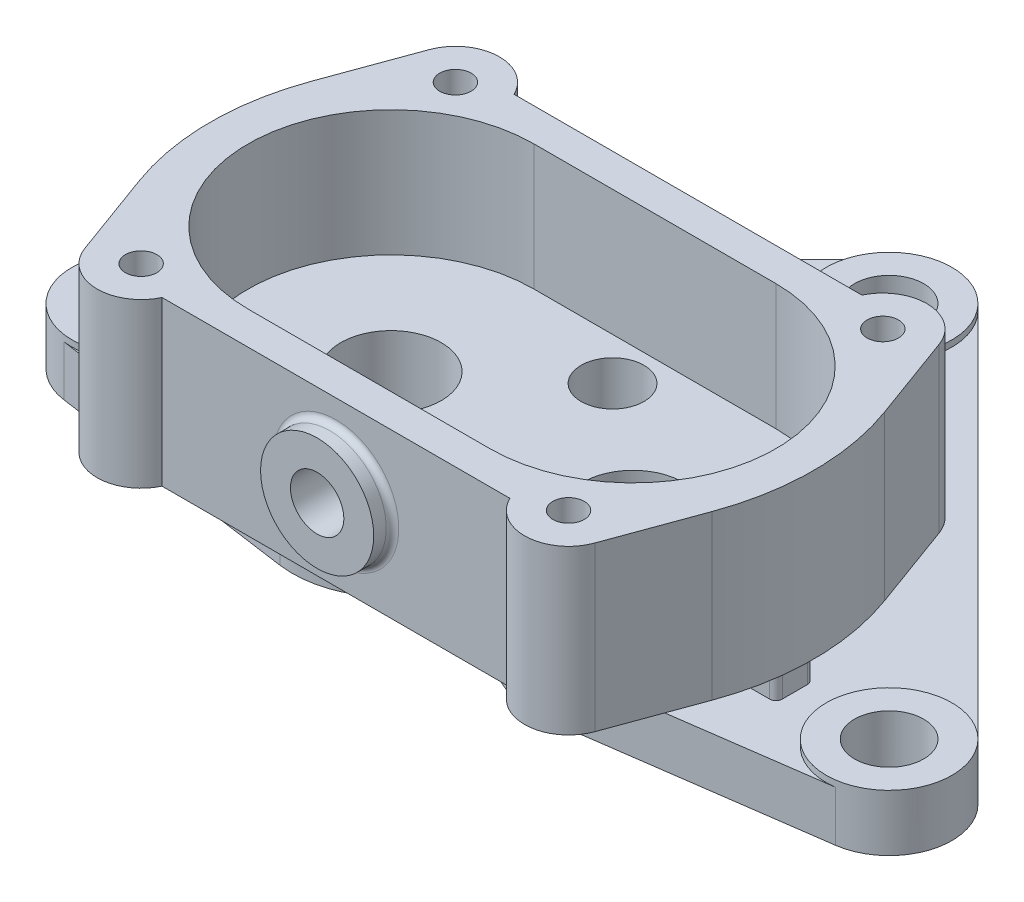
ISO-10303-21;
HEADER;
FILE_DESCRIPTION(('STEP AP214'),'2;1');
FILE_NAME('part.step','',(''),(''),'','','');
FILE_SCHEMA(('AUTOMOTIVE_DESIGN { 1 0 10303 214 1 1 1 1 }'));
ENDSEC;
DATA;
#1=APPLICATION_CONTEXT('core data for automotive mechanical design processes');
#2=APPLICATION_PROTOCOL_DEFINITION('international standard','automotive_design',2000,#1);
#3=PRODUCT_CONTEXT('',#1,'mechanical');
#4=PRODUCT('Part','Part','',(#3));
#5=PRODUCT_RELATED_PRODUCT_CATEGORY('part','',(#4));
#6=PRODUCT_DEFINITION_FORMATION('','',#4);
#7=PRODUCT_DEFINITION_CONTEXT('part definition',#1,'design');
#8=PRODUCT_DEFINITION('design','',#6,#7);
#9=PRODUCT_DEFINITION_SHAPE('','',#8);
#10=(LENGTH_UNIT() NAMED_UNIT(*) SI_UNIT(.MILLI.,.METRE.));
#11=(NAMED_UNIT(*) PLANE_ANGLE_UNIT() SI_UNIT($,.RADIAN.));
#12=(NAMED_UNIT(*) SI_UNIT($,.STERADIAN.) SOLID_ANGLE_UNIT());
#13=UNCERTAINTY_MEASURE_WITH_UNIT(LENGTH_MEASURE(1.E-05),#10,'distance_accuracy_value','');
#14=(GEOMETRIC_REPRESENTATION_CONTEXT(3) GLOBAL_UNCERTAINTY_ASSIGNED_CONTEXT((#13)) GLOBAL_UNIT_ASSIGNED_CONTEXT((#10,
#11,#12)) REPRESENTATION_CONTEXT('',''));
#15=CARTESIAN_POINT('',(0.,0.,0.));
#16=DIRECTION('',(0.,0.,1.));
#17=DIRECTION('',(1.,0.,0.));
#18=AXIS2_PLACEMENT_3D('',#15,#16,#17);
#19=CARTESIAN_POINT('',(0.,14.,44.));
#20=DIRECTION('',(0.,-1.,0.));
#21=DIRECTION('',(0.,0.,-1.));
#22=AXIS2_PLACEMENT_3D('',#19,#20,#21);
#23=CYLINDRICAL_SURFACE('',#22,12.);
#24=DIRECTION('',(0.,-1.,0.));
#25=VECTOR('',#24,1.);
#26=CARTESIAN_POINT('',(-3.,14.,32.3810499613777));
#27=LINE('',#26,#25);
#28=CARTESIAN_POINT('',(-3.,8.,32.3810499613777));
#29=VERTEX_POINT('',#28);
#30=CARTESIAN_POINT('',(-3.,14.,32.3810499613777));
#31=VERTEX_POINT('',#30);
#32=EDGE_CURVE('E400',#29,#31,#27,.F.);
#33=ORIENTED_EDGE('',*,*,#32,.F.);
#34=CARTESIAN_POINT('',(0.,8.,44.));
#35=DIRECTION('',(0.,1.,0.));
#36=DIRECTION('',(0.,0.,1.));
#37=AXIS2_PLACEMENT_3D('',#34,#35,#36);
#38=CIRCLE('',#37,12.);
#39=CARTESIAN_POINT('',(-11.7374214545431,8.,41.5034148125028));
#40=VERTEX_POINT('',#39);
#41=EDGE_CURVE('E609',#29,#40,#38,.T.);
#42=ORIENTED_EDGE('',*,*,#41,.T.);
#43=DIRECTION('',(0.,-1.,0.));
#44=VECTOR('',#43,1.);
#45=CARTESIAN_POINT('',(-11.7374214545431,14.,41.5034148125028));
#46=LINE('',#45,#44);
#47=CARTESIAN_POINT('',(-11.7374214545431,14.,41.5034148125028));
#48=VERTEX_POINT('',#47);
#49=EDGE_CURVE('E679',#48,#40,#46,.T.);
#50=ORIENTED_EDGE('',*,*,#49,.F.);
#51=CARTESIAN_POINT('',(0.,14.,44.));
#52=DIRECTION('',(0.,1.,0.));
#53=DIRECTION('',(0.,0.,1.));
#54=AXIS2_PLACEMENT_3D('',#51,#52,#53);
#55=CIRCLE('',#54,12.);
#56=EDGE_CURVE('E675',#31,#48,#55,.T.);
#57=ORIENTED_EDGE('',*,*,#56,.F.);
#58=EDGE_LOOP('',(#33,#42,#50,#57));
#59=FACE_BOUND('',#58,.T.);
#60=ADVANCED_FACE('F27',(#59),#23,.T.);
#61=CARTESIAN_POINT('',(-8.,14.,60.));
#62=DIRECTION('',(0.,1.,0.));
#63=DIRECTION('',(0.,0.,1.));
#64=AXIS2_PLACEMENT_3D('',#61,#62,#63);
#65=PLANE('',#64);
#66=CARTESIAN_POINT('',(34.,14.,85.));
#67=DIRECTION('',(0.,1.,0.));
#68=DIRECTION('',(0.,0.,1.));
#69=AXIS2_PLACEMENT_3D('',#66,#67,#68);
#70=CIRCLE('',#69,6.99999999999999);
#71=CARTESIAN_POINT('',(27.6754446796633,14.,88.));
#72=VERTEX_POINT('',#71);
#73=CARTESIAN_POINT('',(40.5749719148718,14.,87.4020292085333));
#74=VERTEX_POINT('',#73);
#75=EDGE_CURVE('E470',#72,#74,#70,.T.);
#76=ORIENTED_EDGE('',*,*,#75,.F.);
#77=DIRECTION('',(1.,0.,0.));
#78=VECTOR('',#77,1.);
#79=CARTESIAN_POINT('',(-27.6754446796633,14.,88.));
#80=LINE('',#79,#78);
#81=CARTESIAN_POINT('',(-27.6754446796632,14.,88.));
#82=VERTEX_POINT('',#81);
#83=EDGE_CURVE('E468',#82,#72,#80,.T.);
#84=ORIENTED_EDGE('',*,*,#83,.F.);
#85=CARTESIAN_POINT('',(-34.,14.,85.));
#86=DIRECTION('',(0.,1.,0.));
#87=DIRECTION('',(0.,0.,1.));
#88=AXIS2_PLACEMENT_3D('',#85,#86,#87);
#89=CIRCLE('',#88,7.);
#90=CARTESIAN_POINT('',(-40.5749719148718,14.,87.4020292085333));
#91=VERTEX_POINT('',#90);
#92=EDGE_CURVE('E466',#91,#82,#89,.T.);
#93=ORIENTED_EDGE('',*,*,#92,.F.);
#94=DIRECTION('',(0.34314702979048,0.,0.939281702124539));
#95=VECTOR('',#94,1.);
#96=CARTESIAN_POINT('',(-45.5712680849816,14.,73.7258811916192));
#97=LINE('',#96,#95);
#98=CARTESIAN_POINT('',(-45.5712680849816,14.,73.7258811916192));
#99=VERTEX_POINT('',#98);
#100=EDGE_CURVE('E464',#99,#91,#97,.T.);
#101=ORIENTED_EDGE('',*,*,#100,.F.);
#102=CARTESIAN_POINT('',(-8.,14.,60.));
#103=DIRECTION('',(0.,1.,0.));
#104=DIRECTION('',(0.,0.,1.));
#105=AXIS2_PLACEMENT_3D('',#102,#103,#104);
#106=CIRCLE('',#105,40.);
#107=CARTESIAN_POINT('',(-45.5712680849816,14.,46.2741188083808));
#108=VERTEX_POINT('',#107);
#109=EDGE_CURVE('E461',#108,#99,#106,.T.);
#110=ORIENTED_EDGE('',*,*,#109,.F.);
#111=DIRECTION('',(-0.343147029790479,0.,0.93928170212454));
#112=VECTOR('',#111,1.);
#113=CARTESIAN_POINT('',(-45.5712680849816,14.,46.2741188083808));
#114=LINE('',#113,#112);
#115=CARTESIAN_POINT('',(-40.5749719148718,14.,32.5979707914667));
#116=VERTEX_POINT('',#115);
#117=EDGE_CURVE('E486',#116,#108,#114,.T.);
#118=ORIENTED_EDGE('',*,*,#117,.F.);
#119=CARTESIAN_POINT('',(-34.,14.,35.));
#120=DIRECTION('',(0.,1.,0.));
#121=DIRECTION('',(0.,0.,-1.));
#122=AXIS2_PLACEMENT_3D('',#119,#120,#121);
#123=CIRCLE('',#122,6.99999999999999);
#124=CARTESIAN_POINT('',(-27.6754446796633,14.,32.));
#125=VERTEX_POINT('',#124);
#126=EDGE_CURVE('E484',#125,#116,#123,.T.);
#127=ORIENTED_EDGE('',*,*,#126,.F.);
#128=DIRECTION('',(-1.,0.,0.));
#129=VECTOR('',#128,1.);
#130=CARTESIAN_POINT('',(-27.6754446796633,14.,32.));
#131=LINE('',#130,#129);
#132=CARTESIAN_POINT('',(-3.,14.,32.));
#133=VERTEX_POINT('',#132);
#134=EDGE_CURVE('E480',#133,#125,#131,.T.);
#135=ORIENTED_EDGE('',*,*,#134,.F.);
#136=DIRECTION('',(0.,0.,-1.));
#137=VECTOR('',#136,1.);
#138=CARTESIAN_POINT('',(-3.,14.,60.));
#139=LINE('',#138,#137);
#140=EDGE_CURVE('E397',#31,#133,#139,.T.);
#141=ORIENTED_EDGE('',*,*,#140,.F.);
#142=ORIENTED_EDGE('',*,*,#56,.T.);
#143=CARTESIAN_POINT('',(-15.6498952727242,14.,40.6712197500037));
#144=DIRECTION('',(0.,-1.,0.));
#145=DIRECTION('',(0.,0.,1.));
#146=AXIS2_PLACEMENT_3D('',#143,#144,#145);
#147=CIRCLE('',#146,3.99999999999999);
#148=CARTESIAN_POINT('',(-16.3823238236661,14.,44.6035916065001));
#149=VERTEX_POINT('',#148);
#150=EDGE_CURVE('E613',#48,#149,#147,.T.);
#151=ORIENTED_EDGE('',*,*,#150,.T.);
#152=CARTESIAN_POINT('',(-19.25,14.,60.));
#153=DIRECTION('',(0.,1.,0.));
#154=DIRECTION('',(0.,0.,1.));
#155=AXIS2_PLACEMENT_3D('',#152,#153,#154);
#156=CIRCLE('',#155,15.6611927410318);
#157=CARTESIAN_POINT('',(-34.4531559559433,14.,56.2400788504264));
#158=VERTEX_POINT('',#157);
#159=EDGE_CURVE('E616',#149,#158,#156,.T.);
#160=ORIENTED_EDGE('',*,*,#159,.T.);
#161=CARTESIAN_POINT('',(-35.4239093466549,14.,56.));
#162=DIRECTION('',(0.,-1.,0.));
#163=DIRECTION('',(0.,0.,-1.));
#164=AXIS2_PLACEMENT_3D('',#161,#162,#163);
#165=CIRCLE('',#164,1.);
#166=CARTESIAN_POINT('',(-35.4239093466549,14.,57.));
#167=VERTEX_POINT('',#166);
#168=EDGE_CURVE('E619',#158,#167,#165,.T.);
#169=ORIENTED_EDGE('',*,*,#168,.T.);
#170=DIRECTION('',(-1.,0.,0.));
#171=VECTOR('',#170,1.);
#172=CARTESIAN_POINT('',(-35.4239093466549,14.,57.));
#173=LINE('',#172,#171);
#174=CARTESIAN_POINT('',(-44.,14.,57.));
#175=VERTEX_POINT('',#174);
#176=EDGE_CURVE('E622',#167,#175,#173,.T.);
#177=ORIENTED_EDGE('',*,*,#176,.T.);
#178=CARTESIAN_POINT('',(-44.,14.,58.));
#179=DIRECTION('',(0.,1.,0.));
#180=DIRECTION('',(0.,0.,-1.));
#181=AXIS2_PLACEMENT_3D('',#178,#179,#180);
#182=CIRCLE('',#181,1.);
#183=CARTESIAN_POINT('',(-45.,14.,58.));
#184=VERTEX_POINT('',#183);
#185=EDGE_CURVE('E625',#175,#184,#182,.T.);
#186=ORIENTED_EDGE('',*,*,#185,.T.);
#187=DIRECTION('',(0.,0.,1.));
#188=VECTOR('',#187,1.);
#189=CARTESIAN_POINT('',(-45.,14.,58.));
#190=LINE('',#189,#188);
#191=CARTESIAN_POINT('',(-45.,14.,62.));
#192=VERTEX_POINT('',#191);
#193=EDGE_CURVE('E628',#184,#192,#190,.T.);
#194=ORIENTED_EDGE('',*,*,#193,.T.);
#195=CARTESIAN_POINT('',(-44.,14.,62.));
#196=DIRECTION('',(0.,1.,0.));
#197=DIRECTION('',(0.,0.,1.));
#198=AXIS2_PLACEMENT_3D('',#195,#196,#197);
#199=CIRCLE('',#198,1.);
#200=CARTESIAN_POINT('',(-44.,14.,63.));
#201=VERTEX_POINT('',#200);
#202=EDGE_CURVE('E631',#192,#201,#199,.T.);
#203=ORIENTED_EDGE('',*,*,#202,.T.);
#204=DIRECTION('',(1.,0.,0.));
#205=VECTOR('',#204,1.);
#206=CARTESIAN_POINT('',(-35.4239093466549,14.,63.));
#207=LINE('',#206,#205);
#208=CARTESIAN_POINT('',(-35.4239093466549,14.,63.));
#209=VERTEX_POINT('',#208);
#210=EDGE_CURVE('E634',#201,#209,#207,.T.);
#211=ORIENTED_EDGE('',*,*,#210,.T.);
#212=CARTESIAN_POINT('',(-35.4239093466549,14.,64.));
#213=DIRECTION('',(0.,-1.,0.));
#214=DIRECTION('',(0.,0.,1.));
#215=AXIS2_PLACEMENT_3D('',#212,#213,#214);
#216=CIRCLE('',#215,1.);
#217=CARTESIAN_POINT('',(-34.4531559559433,14.,63.7599211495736));
#218=VERTEX_POINT('',#217);
#219=EDGE_CURVE('E637',#209,#218,#216,.T.);
#220=ORIENTED_EDGE('',*,*,#219,.T.);
#221=CARTESIAN_POINT('',(-19.25,14.,60.));
#222=DIRECTION('',(0.,1.,0.));
#223=DIRECTION('',(0.,0.,1.));
#224=AXIS2_PLACEMENT_3D('',#221,#222,#223);
#225=CIRCLE('',#224,15.6611927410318);
#226=CARTESIAN_POINT('',(-3.91634429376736,14.,63.1862141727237));
#227=VERTEX_POINT('',#226);
#228=EDGE_CURVE('E640',#218,#227,#225,.T.);
#229=ORIENTED_EDGE('',*,*,#228,.T.);
#230=CARTESIAN_POINT('',(0.,14.,64.));
#231=DIRECTION('',(0.,-1.,0.));
#232=DIRECTION('',(0.,0.,1.));
#233=AXIS2_PLACEMENT_3D('',#230,#231,#232);
#234=CIRCLE('',#233,4.);
#235=CARTESIAN_POINT('',(3.91634429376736,14.,63.1862141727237));
#236=VERTEX_POINT('',#235);
#237=EDGE_CURVE('E643',#227,#236,#234,.T.);
#238=ORIENTED_EDGE('',*,*,#237,.T.);
#239=CARTESIAN_POINT('',(19.25,14.,60.));
#240=DIRECTION('',(0.,1.,0.));
#241=DIRECTION('',(0.,0.,1.));
#242=AXIS2_PLACEMENT_3D('',#239,#240,#241);
#243=CIRCLE('',#242,15.6611927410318);
#244=CARTESIAN_POINT('',(34.4531559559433,14.,63.7599211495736));
#245=VERTEX_POINT('',#244);
#246=EDGE_CURVE('E645',#236,#245,#243,.T.);
#247=ORIENTED_EDGE('',*,*,#246,.T.);
#248=CARTESIAN_POINT('',(35.4239093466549,14.,64.));
#249=DIRECTION('',(0.,-1.,0.));
#250=DIRECTION('',(0.,0.,-1.));
#251=AXIS2_PLACEMENT_3D('',#248,#249,#250);
#252=CIRCLE('',#251,1.);
#253=CARTESIAN_POINT('',(35.4239093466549,14.,63.));
#254=VERTEX_POINT('',#253);
#255=EDGE_CURVE('E648',#245,#254,#252,.T.);
#256=ORIENTED_EDGE('',*,*,#255,.T.);
#257=DIRECTION('',(1.,0.,0.));
#258=VECTOR('',#257,1.);
#259=CARTESIAN_POINT('',(35.4239093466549,14.,63.));
#260=LINE('',#259,#258);
#261=CARTESIAN_POINT('',(44.,14.,63.));
#262=VERTEX_POINT('',#261);
#263=EDGE_CURVE('E651',#254,#262,#260,.T.);
#264=ORIENTED_EDGE('',*,*,#263,.T.);
#265=CARTESIAN_POINT('',(44.,14.,62.));
#266=DIRECTION('',(0.,1.,0.));
#267=DIRECTION('',(0.,0.,-1.));
#268=AXIS2_PLACEMENT_3D('',#265,#266,#267);
#269=CIRCLE('',#268,1.);
#270=CARTESIAN_POINT('',(45.,14.,62.));
#271=VERTEX_POINT('',#270);
#272=EDGE_CURVE('E654',#262,#271,#269,.T.);
#273=ORIENTED_EDGE('',*,*,#272,.T.);
#274=DIRECTION('',(0.,0.,-1.));
#275=VECTOR('',#274,1.);
#276=CARTESIAN_POINT('',(45.,14.,58.));
#277=LINE('',#276,#275);
#278=CARTESIAN_POINT('',(45.,14.,58.));
#279=VERTEX_POINT('',#278);
#280=EDGE_CURVE('E657',#271,#279,#277,.T.);
#281=ORIENTED_EDGE('',*,*,#280,.T.);
#282=CARTESIAN_POINT('',(44.,14.,58.));
#283=DIRECTION('',(0.,1.,0.));
#284=DIRECTION('',(0.,0.,1.));
#285=AXIS2_PLACEMENT_3D('',#282,#283,#284);
#286=CIRCLE('',#285,1.);
#287=CARTESIAN_POINT('',(44.,14.,57.));
#288=VERTEX_POINT('',#287);
#289=EDGE_CURVE('E660',#279,#288,#286,.T.);
#290=ORIENTED_EDGE('',*,*,#289,.T.);
#291=DIRECTION('',(-1.,0.,0.));
#292=VECTOR('',#291,1.);
#293=CARTESIAN_POINT('',(35.4239093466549,14.,57.));
#294=LINE('',#293,#292);
#295=CARTESIAN_POINT('',(35.4239093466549,14.,57.));
#296=VERTEX_POINT('',#295);
#297=EDGE_CURVE('E663',#288,#296,#294,.T.);
#298=ORIENTED_EDGE('',*,*,#297,.T.);
#299=CARTESIAN_POINT('',(35.4239093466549,14.,56.));
#300=DIRECTION('',(0.,-1.,0.));
#301=DIRECTION('',(0.,0.,1.));
#302=AXIS2_PLACEMENT_3D('',#299,#300,#301);
#303=CIRCLE('',#302,1.);
#304=CARTESIAN_POINT('',(34.4531559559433,14.,56.2400788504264));
#305=VERTEX_POINT('',#304);
#306=EDGE_CURVE('E666',#296,#305,#303,.T.);
#307=ORIENTED_EDGE('',*,*,#306,.T.);
#308=CARTESIAN_POINT('',(19.25,14.,60.));
#309=DIRECTION('',(0.,1.,0.));
#310=DIRECTION('',(0.,0.,1.));
#311=AXIS2_PLACEMENT_3D('',#308,#309,#310);
#312=CIRCLE('',#311,15.6611927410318);
#313=CARTESIAN_POINT('',(16.3823238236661,14.,44.6035916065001));
#314=VERTEX_POINT('',#313);
#315=EDGE_CURVE('E669',#305,#314,#312,.T.);
#316=ORIENTED_EDGE('',*,*,#315,.T.);
#317=CARTESIAN_POINT('',(15.6498952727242,14.,40.6712197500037));
#318=DIRECTION('',(0.,-1.,0.));
#319=DIRECTION('',(0.,0.,-1.));
#320=AXIS2_PLACEMENT_3D('',#317,#318,#319);
#321=CIRCLE('',#320,3.99999999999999);
#322=CARTESIAN_POINT('',(11.7374214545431,14.,41.5034148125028));
#323=VERTEX_POINT('',#322);
#324=EDGE_CURVE('E672',#314,#323,#321,.T.);
#325=ORIENTED_EDGE('',*,*,#324,.T.);
#326=CARTESIAN_POINT('',(3.,14.,32.3810499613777));
#327=VERTEX_POINT('',#326);
#328=EDGE_CURVE('E676',#323,#327,#55,.T.);
#329=ORIENTED_EDGE('',*,*,#328,.T.);
#330=DIRECTION('',(0.,0.,-1.));
#331=VECTOR('',#330,1.);
#332=CARTESIAN_POINT('',(3.,14.,60.));
#333=LINE('',#332,#331);
#334=CARTESIAN_POINT('',(3.,14.,32.));
#335=VERTEX_POINT('',#334);
#336=EDGE_CURVE('E407',#327,#335,#333,.T.);
#337=ORIENTED_EDGE('',*,*,#336,.T.);
#338=CARTESIAN_POINT('',(27.6754446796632,14.,32.));
#339=VERTEX_POINT('',#338);
#340=EDGE_CURVE('E481',#339,#335,#131,.T.);
#341=ORIENTED_EDGE('',*,*,#340,.F.);
#342=CARTESIAN_POINT('',(34.,14.,35.));
#343=DIRECTION('',(0.,1.,0.));
#344=DIRECTION('',(0.,0.,-1.));
#345=AXIS2_PLACEMENT_3D('',#342,#343,#344);
#346=CIRCLE('',#345,7.);
#347=CARTESIAN_POINT('',(40.5749719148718,14.,32.5979707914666));
#348=VERTEX_POINT('',#347);
#349=EDGE_CURVE('E478',#348,#339,#346,.T.);
#350=ORIENTED_EDGE('',*,*,#349,.F.);
#351=DIRECTION('',(-0.343147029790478,0.,-0.93928170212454));
#352=VECTOR('',#351,1.);
#353=CARTESIAN_POINT('',(45.5712680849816,14.,46.2741188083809));
#354=LINE('',#353,#352);
#355=CARTESIAN_POINT('',(45.5712680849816,14.,46.2741188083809));
#356=VERTEX_POINT('',#355);
#357=EDGE_CURVE('E476',#356,#348,#354,.T.);
#358=ORIENTED_EDGE('',*,*,#357,.F.);
#359=CARTESIAN_POINT('',(8.,14.,60.));
#360=DIRECTION('',(0.,1.,0.));
#361=DIRECTION('',(0.,0.,-1.));
#362=AXIS2_PLACEMENT_3D('',#359,#360,#361);
#363=CIRCLE('',#362,40.);
#364=CARTESIAN_POINT('',(45.5712680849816,14.,73.7258811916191));
#365=VERTEX_POINT('',#364);
#366=EDGE_CURVE('E474',#365,#356,#363,.T.);
#367=ORIENTED_EDGE('',*,*,#366,.F.);
#368=DIRECTION('',(0.343147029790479,0.,-0.939281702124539));
#369=VECTOR('',#368,1.);
#370=CARTESIAN_POINT('',(45.5712680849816,14.,73.7258811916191));
#371=LINE('',#370,#369);
#372=EDGE_CURVE('E472',#74,#365,#371,.T.);
#373=ORIENTED_EDGE('',*,*,#372,.F.);
#374=EDGE_LOOP('',(#76,#84,#93,#101,#110,#118,#127,#135,#141,#142,#151,#160,#169,#177,#186,#194,
#203,#211,#220,#229,#238,#247,#256,#264,#273,#281,#290,#298,#307,#316,#325,#329,#337,#341,#350,
#358,#367,#373));
#375=FACE_BOUND('',#374,.T.);
#376=ADVANCED_FACE('F887',(#375),#65,.F.);
#377=CARTESIAN_POINT('',(-19.25,20.,82.75));
#378=DIRECTION('',(0.,0.,1.));
#379=DIRECTION('',(1.,0.,0.));
#380=AXIS2_PLACEMENT_3D('',#377,#378,#379);
#381=PLANE('',#380);
#382=CARTESIAN_POINT('',(0.,27.,82.75));
#383=DIRECTION('',(0.,0.,1.));
#384=DIRECTION('',(1.,0.,0.));
#385=AXIS2_PLACEMENT_3D('',#382,#383,#384);
#386=CIRCLE('',#385,4.25);
#387=CARTESIAN_POINT('',(4.25,27.,82.75));
#388=VERTEX_POINT('',#387);
#389=EDGE_CURVE('E418',#388,#388,#386,.F.);
#390=ORIENTED_EDGE('',*,*,#389,.F.);
#391=EDGE_LOOP('',(#390));
#392=FACE_BOUND('',#391,.T.);
#393=DIRECTION('',(0.,1.,0.));
#394=VECTOR('',#393,1.);
#395=CARTESIAN_POINT('',(19.25,20.,82.75));
#396=LINE('',#395,#394);
#397=CARTESIAN_POINT('',(19.25,20.,82.75));
#398=VERTEX_POINT('',#397);
#399=CARTESIAN_POINT('',(19.25,40.,82.75));
#400=VERTEX_POINT('',#399);
#401=EDGE_CURVE('E450',#398,#400,#396,.T.);
#402=ORIENTED_EDGE('',*,*,#401,.F.);
#403=DIRECTION('',(1.,0.,0.));
#404=VECTOR('',#403,1.);
#405=CARTESIAN_POINT('',(-19.25,20.,82.75));
#406=LINE('',#405,#404);
#407=CARTESIAN_POINT('',(-19.25,20.,82.75));
#408=VERTEX_POINT('',#407);
#409=EDGE_CURVE('E436',#408,#398,#406,.T.);
#410=ORIENTED_EDGE('',*,*,#409,.F.);
#411=DIRECTION('',(0.,1.,0.));
#412=VECTOR('',#411,1.);
#413=CARTESIAN_POINT('',(-19.25,20.,82.75));
#414=LINE('',#413,#412);
#415=CARTESIAN_POINT('',(-19.25,40.,82.75));
#416=VERTEX_POINT('',#415);
#417=EDGE_CURVE('E443',#408,#416,#414,.T.);
#418=ORIENTED_EDGE('',*,*,#417,.T.);
#419=DIRECTION('',(1.,0.,0.));
#420=VECTOR('',#419,1.);
#421=CARTESIAN_POINT('',(-19.25,40.,82.75));
#422=LINE('',#421,#420);
#423=EDGE_CURVE('E426',#416,#400,#422,.T.);
#424=ORIENTED_EDGE('',*,*,#423,.T.);
#425=EDGE_LOOP('',(#402,#410,#418,#424));
#426=FACE_BOUND('',#425,.T.);
#427=ADVANCED_FACE('F895',(#392,#426),#381,.F.);
#428=CARTESIAN_POINT('',(-27.6754446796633,40.,88.));
#429=DIRECTION('',(0.,0.,-1.));
#430=DIRECTION('',(-1.,0.,0.));
#431=AXIS2_PLACEMENT_3D('',#428,#429,#430);
#432=PLANE('',#431);
#433=CARTESIAN_POINT('',(0.,27.,88.));
#434=DIRECTION('',(0.,0.,-1.));
#435=DIRECTION('',(-1.,0.,0.));
#436=AXIS2_PLACEMENT_3D('',#433,#434,#435);
#437=CIRCLE('',#436,10.);
#438=CARTESIAN_POINT('',(-10.,27.,88.));
#439=VERTEX_POINT('',#438);
#440=EDGE_CURVE('E35',#439,#439,#437,.T.);
#441=ORIENTED_EDGE('',*,*,#440,.T.);
#442=EDGE_LOOP('',(#441));
#443=FACE_BOUND('',#442,.T.);
#444=DIRECTION('',(0.,-1.,0.));
#445=VECTOR('',#444,1.);
#446=CARTESIAN_POINT('',(27.6754446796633,40.,88.));
#447=LINE('',#446,#445);
#448=CARTESIAN_POINT('',(27.6754446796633,40.,88.));
#449=VERTEX_POINT('',#448);
#450=EDGE_CURVE('E537',#449,#72,#447,.T.);
#451=ORIENTED_EDGE('',*,*,#450,.F.);
#452=DIRECTION('',(1.,0.,0.));
#453=VECTOR('',#452,1.);
#454=CARTESIAN_POINT('',(-27.6754446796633,40.,88.));
#455=LINE('',#454,#453);
#456=CARTESIAN_POINT('',(-27.6754446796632,40.,88.));
#457=VERTEX_POINT('',#456);
#458=EDGE_CURVE('E495',#457,#449,#455,.T.);
#459=ORIENTED_EDGE('',*,*,#458,.F.);
#460=DIRECTION('',(0.,-1.,0.));
#461=VECTOR('',#460,1.);
#462=CARTESIAN_POINT('',(-27.6754446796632,40.,88.));
#463=LINE('',#462,#461);
#464=EDGE_CURVE('E540',#457,#82,#463,.T.);
#465=ORIENTED_EDGE('',*,*,#464,.T.);
#466=ORIENTED_EDGE('',*,*,#83,.T.);
#467=EDGE_LOOP('',(#451,#459,#465,#466));
#468=FACE_BOUND('',#467,.T.);
#469=ADVANCED_FACE('F858',(#443,#468),#432,.F.);
#470=CARTESIAN_POINT('',(-19.25,8.,60.));
#471=DIRECTION('',(0.,-1.,0.));
#472=DIRECTION('',(0.,0.,-1.));
#473=AXIS2_PLACEMENT_3D('',#470,#471,#472);
#474=CYLINDRICAL_SURFACE('',#473,8.);
#475=CARTESIAN_POINT('',(-19.25,0.,60.));
#476=DIRECTION('',(0.,1.,0.));
#477=DIRECTION('',(0.,0.,1.));
#478=AXIS2_PLACEMENT_3D('',#475,#476,#477);
#479=CIRCLE('',#478,8.);
#480=CARTESIAN_POINT('',(-19.25,0.,68.));
#481=VERTEX_POINT('',#480);
#482=EDGE_CURVE('E769',#481,#481,#479,.T.);
#483=ORIENTED_EDGE('',*,*,#482,.F.);
#484=EDGE_LOOP('',(#483));
#485=FACE_BOUND('',#484,.T.);
#486=CARTESIAN_POINT('',(-19.25,20.,60.));
#487=DIRECTION('',(0.,1.,0.));
#488=DIRECTION('',(0.,0.,1.));
#489=AXIS2_PLACEMENT_3D('',#486,#487,#488);
#490=CIRCLE('',#489,8.);
#491=CARTESIAN_POINT('',(-19.25,20.,68.));
#492=VERTEX_POINT('',#491);
#493=EDGE_CURVE('E458',#492,#492,#490,.T.);
#494=ORIENTED_EDGE('',*,*,#493,.T.);
#495=EDGE_LOOP('',(#494));
#496=FACE_BOUND('',#495,.T.);
#497=ADVANCED_FACE('F1055',(#485,#496),#474,.F.);
#498=CARTESIAN_POINT('',(19.25,8.,60.));
#499=DIRECTION('',(0.,-1.,0.));
#500=DIRECTION('',(0.,0.,-1.));
#501=AXIS2_PLACEMENT_3D('',#498,#499,#500);
#502=CYLINDRICAL_SURFACE('',#501,8.);
#503=CARTESIAN_POINT('',(19.25,0.,60.));
#504=DIRECTION('',(0.,1.,0.));
#505=DIRECTION('',(0.,0.,1.));
#506=AXIS2_PLACEMENT_3D('',#503,#504,#505);
#507=CIRCLE('',#506,8.);
#508=CARTESIAN_POINT('',(19.25,0.,68.));
#509=VERTEX_POINT('',#508);
#510=EDGE_CURVE('E766',#509,#509,#507,.T.);
#511=ORIENTED_EDGE('',*,*,#510,.F.);
#512=EDGE_LOOP('',(#511));
#513=FACE_BOUND('',#512,.T.);
#514=CARTESIAN_POINT('',(19.25,20.,60.));
#515=DIRECTION('',(0.,1.,0.));
#516=DIRECTION('',(0.,0.,1.));
#517=AXIS2_PLACEMENT_3D('',#514,#515,#516);
#518=CIRCLE('',#517,8.);
#519=CARTESIAN_POINT('',(19.25,20.,68.));
#520=VERTEX_POINT('',#519);
#521=EDGE_CURVE('E455',#520,#520,#518,.T.);
#522=ORIENTED_EDGE('',*,*,#521,.T.);
#523=EDGE_LOOP('',(#522));
#524=FACE_BOUND('',#523,.T.);
#525=ADVANCED_FACE('F1057',(#513,#524),#502,.F.);
#526=CARTESIAN_POINT('',(0.,8.,44.));
#527=DIRECTION('',(0.,-1.,0.));
#528=DIRECTION('',(0.,0.,-1.));
#529=AXIS2_PLACEMENT_3D('',#526,#527,#528);
#530=CYLINDRICAL_SURFACE('',#529,5.);
#531=CARTESIAN_POINT('',(0.,0.,44.));
#532=DIRECTION('',(0.,1.,0.));
#533=DIRECTION('',(0.,0.,1.));
#534=AXIS2_PLACEMENT_3D('',#531,#532,#533);
#535=CIRCLE('',#534,5.);
#536=CARTESIAN_POINT('',(0.,0.,49.));
#537=VERTEX_POINT('',#536);
#538=EDGE_CURVE('E763',#537,#537,#535,.T.);
#539=ORIENTED_EDGE('',*,*,#538,.F.);
#540=EDGE_LOOP('',(#539));
#541=FACE_BOUND('',#540,.T.);
#542=CARTESIAN_POINT('',(0.,20.,44.));
#543=DIRECTION('',(0.,1.,0.));
#544=DIRECTION('',(0.,0.,1.));
#545=AXIS2_PLACEMENT_3D('',#542,#543,#544);
#546=CIRCLE('',#545,5.);
#547=CARTESIAN_POINT('',(0.,20.,49.));
#548=VERTEX_POINT('',#547);
#549=EDGE_CURVE('E447',#548,#548,#546,.T.);
#550=ORIENTED_EDGE('',*,*,#549,.T.);
#551=EDGE_LOOP('',(#550));
#552=FACE_BOUND('',#551,.T.);
#553=ADVANCED_FACE('F1064',(#541,#552),#530,.F.);
#554=CARTESIAN_POINT('',(-60.,8.,60.));
#555=DIRECTION('',(0.,1.,0.));
#556=DIRECTION('',(0.,0.,1.));
#557=AXIS2_PLACEMENT_3D('',#554,#555,#556);
#558=PLANE('',#557);
#559=DIRECTION('',(0.,0.,-1.));
#560=VECTOR('',#559,1.);
#561=CARTESIAN_POINT('',(3.,8.,60.));
#562=LINE('',#561,#560);
#563=CARTESIAN_POINT('',(3.,8.,32.3810499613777));
#564=VERTEX_POINT('',#563);
#565=CARTESIAN_POINT('',(3.,8.,12.));
#566=VERTEX_POINT('',#565);
#567=EDGE_CURVE('E412',#564,#566,#562,.T.);
#568=ORIENTED_EDGE('',*,*,#567,.F.);
#569=CARTESIAN_POINT('',(11.7374214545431,8.,41.5034148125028));
#570=VERTEX_POINT('',#569);
#571=EDGE_CURVE('E610',#570,#564,#38,.T.);
#572=ORIENTED_EDGE('',*,*,#571,.F.);
#573=CARTESIAN_POINT('',(15.6498952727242,8.,40.6712197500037));
#574=DIRECTION('',(0.,-1.,0.));
#575=DIRECTION('',(0.,0.,-1.));
#576=AXIS2_PLACEMENT_3D('',#573,#574,#575);
#577=CIRCLE('',#576,3.99999999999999);
#578=CARTESIAN_POINT('',(16.3823238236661,8.,44.6035916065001));
#579=VERTEX_POINT('',#578);
#580=EDGE_CURVE('E606',#579,#570,#577,.T.);
#581=ORIENTED_EDGE('',*,*,#580,.F.);
#582=CARTESIAN_POINT('',(19.25,8.,60.));
#583=DIRECTION('',(0.,1.,0.));
#584=DIRECTION('',(0.,0.,1.));
#585=AXIS2_PLACEMENT_3D('',#582,#583,#584);
#586=CIRCLE('',#585,15.6611927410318);
#587=CARTESIAN_POINT('',(34.4531559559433,8.,56.2400788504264));
#588=VERTEX_POINT('',#587);
#589=EDGE_CURVE('E603',#588,#579,#586,.T.);
#590=ORIENTED_EDGE('',*,*,#589,.F.);
#591=CARTESIAN_POINT('',(35.4239093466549,8.,56.));
#592=DIRECTION('',(0.,-1.,0.));
#593=DIRECTION('',(0.,0.,1.));
#594=AXIS2_PLACEMENT_3D('',#591,#592,#593);
#595=CIRCLE('',#594,1.);
#596=CARTESIAN_POINT('',(35.4239093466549,8.,57.));
#597=VERTEX_POINT('',#596);
#598=EDGE_CURVE('E600',#597,#588,#595,.T.);
#599=ORIENTED_EDGE('',*,*,#598,.F.);
#600=DIRECTION('',(-1.,0.,0.));
#601=VECTOR('',#600,1.);
#602=CARTESIAN_POINT('',(35.4239093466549,8.,57.));
#603=LINE('',#602,#601);
#604=CARTESIAN_POINT('',(44.,8.,57.));
#605=VERTEX_POINT('',#604);
#606=EDGE_CURVE('E597',#605,#597,#603,.T.);
#607=ORIENTED_EDGE('',*,*,#606,.F.);
#608=CARTESIAN_POINT('',(44.,8.,58.));
#609=DIRECTION('',(0.,1.,0.));
#610=DIRECTION('',(0.,0.,1.));
#611=AXIS2_PLACEMENT_3D('',#608,#609,#610);
#612=CIRCLE('',#611,1.);
#613=CARTESIAN_POINT('',(45.,8.,58.));
#614=VERTEX_POINT('',#613);
#615=EDGE_CURVE('E594',#614,#605,#612,.T.);
#616=ORIENTED_EDGE('',*,*,#615,.F.);
#617=DIRECTION('',(0.,0.,-1.));
#618=VECTOR('',#617,1.);
#619=CARTESIAN_POINT('',(45.,8.,58.));
#620=LINE('',#619,#618);
#621=CARTESIAN_POINT('',(45.,8.,62.));
#622=VERTEX_POINT('',#621);
#623=EDGE_CURVE('E591',#622,#614,#620,.T.);
#624=ORIENTED_EDGE('',*,*,#623,.F.);
#625=CARTESIAN_POINT('',(44.,8.,62.));
#626=DIRECTION('',(0.,1.,0.));
#627=DIRECTION('',(0.,0.,-1.));
#628=AXIS2_PLACEMENT_3D('',#625,#626,#627);
#629=CIRCLE('',#628,1.);
#630=CARTESIAN_POINT('',(44.,8.,63.));
#631=VERTEX_POINT('',#630);
#632=EDGE_CURVE('E588',#631,#622,#629,.T.);
#633=ORIENTED_EDGE('',*,*,#632,.F.);
#634=DIRECTION('',(1.,0.,0.));
#635=VECTOR('',#634,1.);
#636=CARTESIAN_POINT('',(35.4239093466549,8.,63.));
#637=LINE('',#636,#635);
#638=CARTESIAN_POINT('',(35.4239093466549,8.,63.));
#639=VERTEX_POINT('',#638);
#640=EDGE_CURVE('E585',#639,#631,#637,.T.);
#641=ORIENTED_EDGE('',*,*,#640,.F.);
#642=CARTESIAN_POINT('',(35.4239093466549,8.,64.));
#643=DIRECTION('',(0.,-1.,0.));
#644=DIRECTION('',(0.,0.,-1.));
#645=AXIS2_PLACEMENT_3D('',#642,#643,#644);
#646=CIRCLE('',#645,1.);
#647=CARTESIAN_POINT('',(34.4531559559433,8.,63.7599211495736));
#648=VERTEX_POINT('',#647);
#649=EDGE_CURVE('E582',#648,#639,#646,.T.);
#650=ORIENTED_EDGE('',*,*,#649,.F.);
#651=CARTESIAN_POINT('',(19.25,8.,60.));
#652=DIRECTION('',(0.,1.,0.));
#653=DIRECTION('',(0.,0.,1.));
#654=AXIS2_PLACEMENT_3D('',#651,#652,#653);
#655=CIRCLE('',#654,15.6611927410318);
#656=CARTESIAN_POINT('',(21.4257308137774,8.,75.5093247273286));
#657=VERTEX_POINT('',#656);
#658=EDGE_CURVE('E579',#657,#648,#655,.T.);
#659=ORIENTED_EDGE('',*,*,#658,.F.);
#660=DIRECTION('',(0.990302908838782,0.,-0.138924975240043));
#661=VECTOR('',#660,1.);
#662=CARTESIAN_POINT('',(61.3892497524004,8.,69.9030290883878));
#663=LINE('',#662,#661);
#664=CARTESIAN_POINT('',(61.3892497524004,8.,69.9030290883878));
#665=VERTEX_POINT('',#664);
#666=EDGE_CURVE('E804',#657,#665,#663,.T.);
#667=ORIENTED_EDGE('',*,*,#666,.T.);
#668=CARTESIAN_POINT('',(60.,8.,60.));
#669=DIRECTION('',(0.,1.,0.));
#670=DIRECTION('',(0.,0.,1.));
#671=AXIS2_PLACEMENT_3D('',#668,#669,#670);
#672=CIRCLE('',#671,9.99999999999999);
#673=CARTESIAN_POINT('',(67.0710678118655,8.,52.9289321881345));
#674=VERTEX_POINT('',#673);
#675=EDGE_CURVE('E742',#674,#665,#672,.T.);
#676=ORIENTED_EDGE('',*,*,#675,.F.);
#677=DIRECTION('',(-0.707106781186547,0.,-0.707106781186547));
#678=VECTOR('',#677,1.);
#679=CARTESIAN_POINT('',(67.0710678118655,8.,52.9289321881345));
#680=LINE('',#679,#678);
#681=CARTESIAN_POINT('',(7.07106781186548,8.,-7.07106781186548));
#682=VERTEX_POINT('',#681);
#683=EDGE_CURVE('E806',#674,#682,#680,.T.);
#684=ORIENTED_EDGE('',*,*,#683,.T.);
#685=CARTESIAN_POINT('',(0.,8.,0.));
#686=DIRECTION('',(0.,1.,0.));
#687=DIRECTION('',(0.,0.,1.));
#688=AXIS2_PLACEMENT_3D('',#685,#686,#687);
#689=CIRCLE('',#688,10.);
#690=CARTESIAN_POINT('',(-7.07106781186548,8.,-7.07106781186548));
#691=VERTEX_POINT('',#690);
#692=EDGE_CURVE('E834',#691,#682,#689,.T.);
#693=ORIENTED_EDGE('',*,*,#692,.F.);
#694=DIRECTION('',(-0.707106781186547,0.,0.707106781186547));
#695=VECTOR('',#694,1.);
#696=CARTESIAN_POINT('',(-67.0710678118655,8.,52.9289321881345));
#697=LINE('',#696,#695);
#698=CARTESIAN_POINT('',(-67.0710678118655,8.,52.9289321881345));
#699=VERTEX_POINT('',#698);
#700=EDGE_CURVE('E811',#691,#699,#697,.T.);
#701=ORIENTED_EDGE('',*,*,#700,.T.);
#702=CARTESIAN_POINT('',(-60.,8.,60.));
#703=DIRECTION('',(0.,1.,0.));
#704=DIRECTION('',(0.,0.,1.));
#705=AXIS2_PLACEMENT_3D('',#702,#703,#704);
#706=CIRCLE('',#705,9.99999999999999);
#707=CARTESIAN_POINT('',(-61.3892497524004,8.,69.9030290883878));
#708=VERTEX_POINT('',#707);
#709=EDGE_CURVE('E751',#708,#699,#706,.T.);
#710=ORIENTED_EDGE('',*,*,#709,.F.);
#711=DIRECTION('',(0.990302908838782,0.,0.138924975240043));
#712=VECTOR('',#711,1.);
#713=CARTESIAN_POINT('',(-61.3892497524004,8.,69.9030290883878));
#714=LINE('',#713,#712);
#715=CARTESIAN_POINT('',(-21.4257308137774,8.,75.5093247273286));
#716=VERTEX_POINT('',#715);
#717=EDGE_CURVE('E802',#708,#716,#714,.T.);
#718=ORIENTED_EDGE('',*,*,#717,.T.);
#719=CARTESIAN_POINT('',(-19.25,8.,60.));
#720=DIRECTION('',(0.,1.,0.));
#721=DIRECTION('',(0.,0.,1.));
#722=AXIS2_PLACEMENT_3D('',#719,#720,#721);
#723=CIRCLE('',#722,15.6611927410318);
#724=CARTESIAN_POINT('',(-34.4531559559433,8.,63.7599211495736));
#725=VERTEX_POINT('',#724);
#726=EDGE_CURVE('E576',#725,#716,#723,.T.);
#727=ORIENTED_EDGE('',*,*,#726,.F.);
#728=CARTESIAN_POINT('',(-35.4239093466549,8.,64.));
#729=DIRECTION('',(0.,-1.,0.));
#730=DIRECTION('',(0.,0.,1.));
#731=AXIS2_PLACEMENT_3D('',#728,#729,#730);
#732=CIRCLE('',#731,1.);
#733=CARTESIAN_POINT('',(-35.4239093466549,8.,63.));
#734=VERTEX_POINT('',#733);
#735=EDGE_CURVE('E573',#734,#725,#732,.T.);
#736=ORIENTED_EDGE('',*,*,#735,.F.);
#737=DIRECTION('',(1.,0.,0.));
#738=VECTOR('',#737,1.);
#739=CARTESIAN_POINT('',(-35.4239093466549,8.,63.));
#740=LINE('',#739,#738);
#741=CARTESIAN_POINT('',(-44.,8.,63.));
#742=VERTEX_POINT('',#741);
#743=EDGE_CURVE('E570',#742,#734,#740,.T.);
#744=ORIENTED_EDGE('',*,*,#743,.F.);
#745=CARTESIAN_POINT('',(-44.,8.,62.));
#746=DIRECTION('',(0.,1.,0.));
#747=DIRECTION('',(0.,0.,1.));
#748=AXIS2_PLACEMENT_3D('',#745,#746,#747);
#749=CIRCLE('',#748,1.);
#750=CARTESIAN_POINT('',(-45.,8.,62.));
#751=VERTEX_POINT('',#750);
#752=EDGE_CURVE('E567',#751,#742,#749,.T.);
#753=ORIENTED_EDGE('',*,*,#752,.F.);
#754=DIRECTION('',(0.,0.,1.));
#755=VECTOR('',#754,1.);
#756=CARTESIAN_POINT('',(-45.,8.,58.));
#757=LINE('',#756,#755);
#758=CARTESIAN_POINT('',(-45.,8.,58.));
#759=VERTEX_POINT('',#758);
#760=EDGE_CURVE('E564',#759,#751,#757,.T.);
#761=ORIENTED_EDGE('',*,*,#760,.F.);
#762=CARTESIAN_POINT('',(-44.,8.,58.));
#763=DIRECTION('',(0.,1.,0.));
#764=DIRECTION('',(0.,0.,-1.));
#765=AXIS2_PLACEMENT_3D('',#762,#763,#764);
#766=CIRCLE('',#765,1.);
#767=CARTESIAN_POINT('',(-44.,8.,57.));
#768=VERTEX_POINT('',#767);
#769=EDGE_CURVE('E561',#768,#759,#766,.T.);
#770=ORIENTED_EDGE('',*,*,#769,.F.);
#771=DIRECTION('',(-1.,0.,0.));
#772=VECTOR('',#771,1.);
#773=CARTESIAN_POINT('',(-35.4239093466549,8.,57.));
#774=LINE('',#773,#772);
#775=CARTESIAN_POINT('',(-35.4239093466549,8.,57.));
#776=VERTEX_POINT('',#775);
#777=EDGE_CURVE('E558',#776,#768,#774,.T.);
#778=ORIENTED_EDGE('',*,*,#777,.F.);
#779=CARTESIAN_POINT('',(-35.4239093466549,8.,56.));
#780=DIRECTION('',(0.,-1.,0.));
#781=DIRECTION('',(0.,0.,-1.));
#782=AXIS2_PLACEMENT_3D('',#779,#780,#781);
#783=CIRCLE('',#782,1.);
#784=CARTESIAN_POINT('',(-34.4531559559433,8.,56.2400788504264));
#785=VERTEX_POINT('',#784);
#786=EDGE_CURVE('E555',#785,#776,#783,.T.);
#787=ORIENTED_EDGE('',*,*,#786,.F.);
#788=CARTESIAN_POINT('',(-19.25,8.,60.));
#789=DIRECTION('',(0.,1.,0.));
#790=DIRECTION('',(0.,0.,1.));
#791=AXIS2_PLACEMENT_3D('',#788,#789,#790);
#792=CIRCLE('',#791,15.6611927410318);
#793=CARTESIAN_POINT('',(-16.3823238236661,8.,44.6035916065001));
#794=VERTEX_POINT('',#793);
#795=EDGE_CURVE('E552',#794,#785,#792,.T.);
#796=ORIENTED_EDGE('',*,*,#795,.F.);
#797=CARTESIAN_POINT('',(-15.6498952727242,8.,40.6712197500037));
#798=DIRECTION('',(0.,-1.,0.));
#799=DIRECTION('',(0.,0.,1.));
#800=AXIS2_PLACEMENT_3D('',#797,#798,#799);
#801=CIRCLE('',#800,3.99999999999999);
#802=EDGE_CURVE('E549',#40,#794,#801,.T.);
#803=ORIENTED_EDGE('',*,*,#802,.F.);
#804=ORIENTED_EDGE('',*,*,#41,.F.);
#805=DIRECTION('',(0.,0.,-1.));
#806=VECTOR('',#805,1.);
#807=CARTESIAN_POINT('',(-3.,8.,60.));
#808=LINE('',#807,#806);
#809=CARTESIAN_POINT('',(-3.,8.,12.));
#810=VERTEX_POINT('',#809);
#811=EDGE_CURVE('E47',#29,#810,#808,.T.);
#812=ORIENTED_EDGE('',*,*,#811,.T.);
#813=DIRECTION('',(-1.,0.,0.));
#814=VECTOR('',#813,1.);
#815=CARTESIAN_POINT('',(-60.,8.,12.));
#816=LINE('',#815,#814);
#817=EDGE_CURVE('E42',#566,#810,#816,.T.);
#818=ORIENTED_EDGE('',*,*,#817,.F.);
#819=EDGE_LOOP('',(#568,#572,#581,#590,#599,#607,#616,#624,#633,#641,#650,#659,#667,#676,#684,
#693,#701,#710,#718,#727,#736,#744,#753,#761,#770,#778,#787,#796,#803,#804,#812,#818));
#820=FACE_BOUND('',#819,.T.);
#821=ADVANCED_FACE('F1089',(#820),#558,.T.);
#822=CARTESIAN_POINT('',(-60.,0.,60.));
#823=DIRECTION('',(0.,1.,0.));
#824=DIRECTION('',(0.,0.,1.));
#825=AXIS2_PLACEMENT_3D('',#822,#823,#824);
#826=PLANE('',#825);
#827=ORIENTED_EDGE('',*,*,#538,.T.);
#828=EDGE_LOOP('',(#827));
#829=FACE_BOUND('',#828,.T.);
#830=ORIENTED_EDGE('',*,*,#510,.T.);
#831=EDGE_LOOP('',(#830));
#832=FACE_BOUND('',#831,.T.);
#833=CARTESIAN_POINT('',(60.,0.,60.));
#834=DIRECTION('',(0.,1.,0.));
#835=DIRECTION('',(0.,0.,-1.));
#836=AXIS2_PLACEMENT_3D('',#833,#834,#835);
#837=CIRCLE('',#836,5.5);
#838=CARTESIAN_POINT('',(60.,0.,54.5));
#839=VERTEX_POINT('',#838);
#840=EDGE_CURVE('E772',#839,#839,#837,.T.);
#841=ORIENTED_EDGE('',*,*,#840,.T.);
#842=EDGE_LOOP('',(#841));
#843=FACE_BOUND('',#842,.T.);
#844=CARTESIAN_POINT('',(0.,0.,0.));
#845=DIRECTION('',(0.,1.,0.));
#846=DIRECTION('',(0.,0.,1.));
#847=AXIS2_PLACEMENT_3D('',#844,#845,#846);
#848=CIRCLE('',#847,5.5);
#849=CARTESIAN_POINT('',(0.,0.,5.5));
#850=VERTEX_POINT('',#849);
#851=EDGE_CURVE('E778',#850,#850,#848,.T.);
#852=ORIENTED_EDGE('',*,*,#851,.T.);
#853=EDGE_LOOP('',(#852));
#854=FACE_BOUND('',#853,.T.);
#855=CARTESIAN_POINT('',(19.25,0.,60.));
#856=DIRECTION('',(0.,1.,0.));
#857=DIRECTION('',(0.,0.,-1.));
#858=AXIS2_PLACEMENT_3D('',#855,#856,#857);
#859=CIRCLE('',#858,15.6611927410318);
#860=CARTESIAN_POINT('',(3.91634429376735,0.,63.1862141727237));
#861=VERTEX_POINT('',#860);
#862=CARTESIAN_POINT('',(21.4257308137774,0.,75.5093247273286));
#863=VERTEX_POINT('',#862);
#864=EDGE_CURVE('E790',#861,#863,#859,.T.);
#865=ORIENTED_EDGE('',*,*,#864,.F.);
#866=CARTESIAN_POINT('',(0.,0.,64.));
#867=DIRECTION('',(0.,-1.,0.));
#868=DIRECTION('',(0.,0.,-1.));
#869=AXIS2_PLACEMENT_3D('',#866,#867,#868);
#870=CIRCLE('',#869,4.);
#871=CARTESIAN_POINT('',(-3.91634429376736,0.,63.1862141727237));
#872=VERTEX_POINT('',#871);
#873=EDGE_CURVE('E788',#872,#861,#870,.T.);
#874=ORIENTED_EDGE('',*,*,#873,.F.);
#875=CARTESIAN_POINT('',(-19.25,0.,60.));
#876=DIRECTION('',(0.,1.,0.));
#877=DIRECTION('',(0.,0.,1.));
#878=AXIS2_PLACEMENT_3D('',#875,#876,#877);
#879=CIRCLE('',#878,15.6611927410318);
#880=CARTESIAN_POINT('',(-21.4257308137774,0.,75.5093247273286));
#881=VERTEX_POINT('',#880);
#882=EDGE_CURVE('E786',#881,#872,#879,.T.);
#883=ORIENTED_EDGE('',*,*,#882,.F.);
#884=DIRECTION('',(0.990302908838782,0.,0.138924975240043));
#885=VECTOR('',#884,1.);
#886=CARTESIAN_POINT('',(-61.3892497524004,0.,69.9030290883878));
#887=LINE('',#886,#885);
#888=CARTESIAN_POINT('',(-61.3892497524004,0.,69.9030290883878));
#889=VERTEX_POINT('',#888);
#890=EDGE_CURVE('E784',#889,#881,#887,.T.);
#891=ORIENTED_EDGE('',*,*,#890,.F.);
#892=CARTESIAN_POINT('',(-60.,0.,60.));
#893=DIRECTION('',(0.,1.,0.));
#894=DIRECTION('',(0.,0.,1.));
#895=AXIS2_PLACEMENT_3D('',#892,#893,#894);
#896=CIRCLE('',#895,10.);
#897=CARTESIAN_POINT('',(-67.0710678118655,0.,52.9289321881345));
#898=VERTEX_POINT('',#897);
#899=EDGE_CURVE('E781',#898,#889,#896,.T.);
#900=ORIENTED_EDGE('',*,*,#899,.F.);
#901=DIRECTION('',(-0.707106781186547,0.,0.707106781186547));
#902=VECTOR('',#901,1.);
#903=CARTESIAN_POINT('',(-67.0710678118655,0.,52.9289321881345));
#904=LINE('',#903,#902);
#905=CARTESIAN_POINT('',(-7.07106781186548,0.,-7.07106781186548));
#906=VERTEX_POINT('',#905);
#907=EDGE_CURVE('E800',#906,#898,#904,.T.);
#908=ORIENTED_EDGE('',*,*,#907,.F.);
#909=CARTESIAN_POINT('',(0.,0.,0.));
#910=DIRECTION('',(0.,1.,0.));
#911=DIRECTION('',(0.,0.,1.));
#912=AXIS2_PLACEMENT_3D('',#909,#910,#911);
#913=CIRCLE('',#912,10.);
#914=CARTESIAN_POINT('',(7.07106781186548,0.,-7.07106781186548));
#915=VERTEX_POINT('',#914);
#916=EDGE_CURVE('E798',#915,#906,#913,.T.);
#917=ORIENTED_EDGE('',*,*,#916,.F.);
#918=DIRECTION('',(-0.707106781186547,0.,-0.707106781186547));
#919=VECTOR('',#918,1.);
#920=CARTESIAN_POINT('',(67.0710678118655,0.,52.9289321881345));
#921=LINE('',#920,#919);
#922=CARTESIAN_POINT('',(67.0710678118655,0.,52.9289321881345));
#923=VERTEX_POINT('',#922);
#924=EDGE_CURVE('E796',#923,#915,#921,.T.);
#925=ORIENTED_EDGE('',*,*,#924,.F.);
#926=CARTESIAN_POINT('',(60.,0.,60.));
#927=DIRECTION('',(0.,1.,0.));
#928=DIRECTION('',(0.,0.,1.));
#929=AXIS2_PLACEMENT_3D('',#926,#927,#928);
#930=CIRCLE('',#929,10.);
#931=CARTESIAN_POINT('',(61.3892497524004,0.,69.9030290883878));
#932=VERTEX_POINT('',#931);
#933=EDGE_CURVE('E794',#932,#923,#930,.T.);
#934=ORIENTED_EDGE('',*,*,#933,.F.);
#935=DIRECTION('',(0.990302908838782,0.,-0.138924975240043));
#936=VECTOR('',#935,1.);
#937=CARTESIAN_POINT('',(61.3892497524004,0.,69.9030290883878));
#938=LINE('',#937,#936);
#939=EDGE_CURVE('E792',#863,#932,#938,.T.);
#940=ORIENTED_EDGE('',*,*,#939,.F.);
#941=EDGE_LOOP('',(#865,#874,#883,#891,#900,#908,#917,#925,#934,#940));
#942=FACE_BOUND('',#941,.T.);
#943=CARTESIAN_POINT('',(-60.,0.,60.));
#944=DIRECTION('',(0.,1.,0.));
#945=DIRECTION('',(0.,0.,1.));
#946=AXIS2_PLACEMENT_3D('',#943,#944,#945);
#947=CIRCLE('',#946,5.5);
#948=CARTESIAN_POINT('',(-60.,0.,65.5));
#949=VERTEX_POINT('',#948);
#950=EDGE_CURVE('E775',#949,#949,#947,.T.);
#951=ORIENTED_EDGE('',*,*,#950,.T.);
#952=EDGE_LOOP('',(#951));
#953=FACE_BOUND('',#952,.T.);
#954=ORIENTED_EDGE('',*,*,#482,.T.);
#955=EDGE_LOOP('',(#954));
#956=FACE_BOUND('',#955,.T.);
#957=ADVANCED_FACE('F1086',(#829,#832,#843,#854,#942,#953,#956),#826,.F.);
#958=CARTESIAN_POINT('',(-60.,8.,60.));
#959=DIRECTION('',(0.,-1.,0.));
#960=DIRECTION('',(0.,0.,-1.));
#961=AXIS2_PLACEMENT_3D('',#958,#959,#960);
#962=CYLINDRICAL_SURFACE('',#961,10.);
#963=ORIENTED_EDGE('',*,*,#899,.T.);
#964=DIRECTION('',(0.,-1.,0.));
#965=VECTOR('',#964,1.);
#966=CARTESIAN_POINT('',(-61.3892497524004,8.,69.9030290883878));
#967=LINE('',#966,#965);
#968=EDGE_CURVE('E831',#708,#889,#967,.T.);
#969=ORIENTED_EDGE('',*,*,#968,.F.);
#970=ORIENTED_EDGE('',*,*,#709,.T.);
#971=DIRECTION('',(0.,-1.,0.));
#972=VECTOR('',#971,1.);
#973=CARTESIAN_POINT('',(-67.0710678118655,8.,52.9289321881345));
#974=LINE('',#973,#972);
#975=EDGE_CURVE('E807',#699,#898,#974,.T.);
#976=ORIENTED_EDGE('',*,*,#975,.T.);
#977=EDGE_LOOP('',(#963,#969,#970,#976));
#978=FACE_BOUND('',#977,.T.);
#979=CARTESIAN_POINT('',(-60.,9.,60.));
#980=DIRECTION('',(0.,1.,0.));
#981=DIRECTION('',(0.,0.,1.));
#982=AXIS2_PLACEMENT_3D('',#979,#980,#981);
#983=CIRCLE('',#982,9.99999999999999);
#984=CARTESIAN_POINT('',(-60.,9.,70.));
#985=VERTEX_POINT('',#984);
#986=EDGE_CURVE('E754',#985,#985,#983,.T.);
#987=ORIENTED_EDGE('',*,*,#986,.F.);
#988=EDGE_LOOP('',(#987));
#989=FACE_BOUND('',#988,.T.);
#990=ADVANCED_FACE('F29',(#978,#989),#962,.T.);
#991=CARTESIAN_POINT('',(-61.3892497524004,8.,69.9030290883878));
#992=DIRECTION('',(0.138924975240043,0.,-0.990302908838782));
#993=DIRECTION('',(-0.990302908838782,0.,-0.138924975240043));
#994=AXIS2_PLACEMENT_3D('',#991,#992,#993);
#995=PLANE('',#994);
#996=ORIENTED_EDGE('',*,*,#890,.T.);
#997=DIRECTION('',(0.,-1.,0.));
#998=VECTOR('',#997,1.);
#999=CARTESIAN_POINT('',(-21.4257308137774,8.,75.5093247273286));
#1000=LINE('',#999,#998);
#1001=EDGE_CURVE('E828',#716,#881,#1000,.T.);
#1002=ORIENTED_EDGE('',*,*,#1001,.F.);
#1003=ORIENTED_EDGE('',*,*,#717,.F.);
#1004=ORIENTED_EDGE('',*,*,#968,.T.);
#1005=EDGE_LOOP('',(#996,#1002,#1003,#1004));
#1006=FACE_BOUND('',#1005,.T.);
#1007=ADVANCED_FACE('F1121',(#1006),#995,.F.);
#1008=CARTESIAN_POINT('',(-19.25,8.,60.));
#1009=DIRECTION('',(0.,-1.,0.));
#1010=DIRECTION('',(0.,0.,-1.));
#1011=AXIS2_PLACEMENT_3D('',#1008,#1009,#1010);
#1012=CYLINDRICAL_SURFACE('',#1011,15.6611927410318);
#1013=ORIENTED_EDGE('',*,*,#882,.T.);
#1014=DIRECTION('',(0.,-1.,0.));
#1015=VECTOR('',#1014,1.);
#1016=CARTESIAN_POINT('',(-3.91634429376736,8.,63.1862141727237));
#1017=LINE('',#1016,#1015);
#1018=EDGE_CURVE('E825',#227,#872,#1017,.T.);
#1019=ORIENTED_EDGE('',*,*,#1018,.F.);
#1020=ORIENTED_EDGE('',*,*,#228,.F.);
#1021=DIRECTION('',(0.,-1.,0.));
#1022=VECTOR('',#1021,1.);
#1023=CARTESIAN_POINT('',(-34.4531559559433,14.,63.7599211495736));
#1024=LINE('',#1023,#1022);
#1025=EDGE_CURVE('E712',#218,#725,#1024,.T.);
#1026=ORIENTED_EDGE('',*,*,#1025,.T.);
#1027=ORIENTED_EDGE('',*,*,#726,.T.);
#1028=ORIENTED_EDGE('',*,*,#1001,.T.);
#1029=EDGE_LOOP('',(#1013,#1019,#1020,#1026,#1027,#1028));
#1030=FACE_BOUND('',#1029,.T.);
#1031=ADVANCED_FACE('F1118',(#1030),#1012,.T.);
#1032=CARTESIAN_POINT('',(0.,8.,64.));
#1033=DIRECTION('',(0.,-1.,0.));
#1034=DIRECTION('',(0.,0.,-1.));
#1035=AXIS2_PLACEMENT_3D('',#1032,#1033,#1034);
#1036=CYLINDRICAL_SURFACE('',#1035,4.);
#1037=DIRECTION('',(0.,-1.,0.));
#1038=VECTOR('',#1037,1.);
#1039=CARTESIAN_POINT('',(3.91634429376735,8.,63.1862141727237));
#1040=LINE('',#1039,#1038);
#1041=EDGE_CURVE('E822',#236,#861,#1040,.T.);
#1042=ORIENTED_EDGE('',*,*,#1041,.F.);
#1043=ORIENTED_EDGE('',*,*,#237,.F.);
#1044=ORIENTED_EDGE('',*,*,#1018,.T.);
#1045=ORIENTED_EDGE('',*,*,#873,.T.);
#1046=EDGE_LOOP('',(#1042,#1043,#1044,#1045));
#1047=FACE_BOUND('',#1046,.T.);
#1048=ADVANCED_FACE('F1115',(#1047),#1036,.F.);
#1049=CARTESIAN_POINT('',(19.25,8.,60.));
#1050=DIRECTION('',(0.,-1.,0.));
#1051=DIRECTION('',(0.,0.,-1.));
#1052=AXIS2_PLACEMENT_3D('',#1049,#1050,#1051);
#1053=CYLINDRICAL_SURFACE('',#1052,15.6611927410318);
#1054=ORIENTED_EDGE('',*,*,#864,.T.);
#1055=DIRECTION('',(0.,-1.,0.));
#1056=VECTOR('',#1055,1.);
#1057=CARTESIAN_POINT('',(21.4257308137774,8.,75.5093247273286));
#1058=LINE('',#1057,#1056);
#1059=EDGE_CURVE('E819',#657,#863,#1058,.T.);
#1060=ORIENTED_EDGE('',*,*,#1059,.F.);
#1061=ORIENTED_EDGE('',*,*,#658,.T.);
#1062=DIRECTION('',(0.,-1.,0.));
#1063=VECTOR('',#1062,1.);
#1064=CARTESIAN_POINT('',(34.4531559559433,14.,63.7599211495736));
#1065=LINE('',#1064,#1063);
#1066=EDGE_CURVE('E709',#245,#648,#1065,.T.);
#1067=ORIENTED_EDGE('',*,*,#1066,.F.);
#1068=ORIENTED_EDGE('',*,*,#246,.F.);
#1069=ORIENTED_EDGE('',*,*,#1041,.T.);
#1070=EDGE_LOOP('',(#1054,#1060,#1061,#1067,#1068,#1069));
#1071=FACE_BOUND('',#1070,.T.);
#1072=ADVANCED_FACE('F1111',(#1071),#1053,.T.);
#1073=CARTESIAN_POINT('',(61.3892497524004,8.,69.9030290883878));
#1074=DIRECTION('',(-0.138924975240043,0.,-0.990302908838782));
#1075=DIRECTION('',(-0.990302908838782,0.,0.138924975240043));
#1076=AXIS2_PLACEMENT_3D('',#1073,#1074,#1075);
#1077=PLANE('',#1076);
#1078=ORIENTED_EDGE('',*,*,#939,.T.);
#1079=DIRECTION('',(0.,-1.,0.));
#1080=VECTOR('',#1079,1.);
#1081=CARTESIAN_POINT('',(61.3892497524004,8.,69.9030290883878));
#1082=LINE('',#1081,#1080);
#1083=EDGE_CURVE('E815',#665,#932,#1082,.T.);
#1084=ORIENTED_EDGE('',*,*,#1083,.F.);
#1085=ORIENTED_EDGE('',*,*,#666,.F.);
#1086=ORIENTED_EDGE('',*,*,#1059,.T.);
#1087=EDGE_LOOP('',(#1078,#1084,#1085,#1086));
#1088=FACE_BOUND('',#1087,.T.);
#1089=ADVANCED_FACE('F1107',(#1088),#1077,.F.);
#1090=CARTESIAN_POINT('',(60.,8.,60.));
#1091=DIRECTION('',(0.,-1.,0.));
#1092=DIRECTION('',(0.,0.,-1.));
#1093=AXIS2_PLACEMENT_3D('',#1090,#1091,#1092);
#1094=CYLINDRICAL_SURFACE('',#1093,10.);
#1095=ORIENTED_EDGE('',*,*,#933,.T.);
#1096=DIRECTION('',(0.,-1.,0.));
#1097=VECTOR('',#1096,1.);
#1098=CARTESIAN_POINT('',(67.0710678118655,8.,52.9289321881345));
#1099=LINE('',#1098,#1097);
#1100=EDGE_CURVE('E812',#674,#923,#1099,.T.);
#1101=ORIENTED_EDGE('',*,*,#1100,.F.);
#1102=ORIENTED_EDGE('',*,*,#675,.T.);
#1103=ORIENTED_EDGE('',*,*,#1083,.T.);
#1104=EDGE_LOOP('',(#1095,#1101,#1102,#1103));
#1105=FACE_BOUND('',#1104,.T.);
#1106=CARTESIAN_POINT('',(60.,9.,60.));
#1107=DIRECTION('',(0.,1.,0.));
#1108=DIRECTION('',(0.,0.,1.));
#1109=AXIS2_PLACEMENT_3D('',#1106,#1107,#1108);
#1110=CIRCLE('',#1109,9.99999999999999);
#1111=CARTESIAN_POINT('',(60.,9.,70.));
#1112=VERTEX_POINT('',#1111);
#1113=EDGE_CURVE('E745',#1112,#1112,#1110,.T.);
#1114=ORIENTED_EDGE('',*,*,#1113,.F.);
#1115=EDGE_LOOP('',(#1114));
#1116=FACE_BOUND('',#1115,.T.);
#1117=ADVANCED_FACE('F1103',(#1105,#1116),#1094,.T.);
#1118=CARTESIAN_POINT('',(67.0710678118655,8.,52.9289321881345));
#1119=DIRECTION('',(-0.707106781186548,0.,0.707106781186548));
#1120=DIRECTION('',(0.707106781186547,0.,0.707106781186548));
#1121=AXIS2_PLACEMENT_3D('',#1118,#1119,#1120);
#1122=PLANE('',#1121);
#1123=ORIENTED_EDGE('',*,*,#924,.T.);
#1124=DIRECTION('',(0.,-1.,0.));
#1125=VECTOR('',#1124,1.);
#1126=CARTESIAN_POINT('',(7.07106781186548,8.,-7.07106781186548));
#1127=LINE('',#1126,#1125);
#1128=EDGE_CURVE('E816',#682,#915,#1127,.T.);
#1129=ORIENTED_EDGE('',*,*,#1128,.F.);
#1130=ORIENTED_EDGE('',*,*,#683,.F.);
#1131=ORIENTED_EDGE('',*,*,#1100,.T.);
#1132=EDGE_LOOP('',(#1123,#1129,#1130,#1131));
#1133=FACE_BOUND('',#1132,.T.);
#1134=ADVANCED_FACE('F1099',(#1133),#1122,.F.);
#1135=CARTESIAN_POINT('',(0.,8.,0.));
#1136=DIRECTION('',(0.,-1.,0.));
#1137=DIRECTION('',(0.,0.,-1.));
#1138=AXIS2_PLACEMENT_3D('',#1135,#1136,#1137);
#1139=CYLINDRICAL_SURFACE('',#1138,10.);
#1140=ORIENTED_EDGE('',*,*,#916,.T.);
#1141=DIRECTION('',(0.,-1.,0.));
#1142=VECTOR('',#1141,1.);
#1143=CARTESIAN_POINT('',(-7.07106781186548,8.,-7.07106781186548));
#1144=LINE('',#1143,#1142);
#1145=EDGE_CURVE('E810',#691,#906,#1144,.T.);
#1146=ORIENTED_EDGE('',*,*,#1145,.F.);
#1147=ORIENTED_EDGE('',*,*,#692,.T.);
#1148=ORIENTED_EDGE('',*,*,#1128,.T.);
#1149=EDGE_LOOP('',(#1140,#1146,#1147,#1148));
#1150=FACE_BOUND('',#1149,.T.);
#1151=CARTESIAN_POINT('',(0.,9.,0.));
#1152=DIRECTION('',(0.,1.,0.));
#1153=DIRECTION('',(0.,0.,1.));
#1154=AXIS2_PLACEMENT_3D('',#1151,#1152,#1153);
#1155=CIRCLE('',#1154,10.);
#1156=CARTESIAN_POINT('',(0.,9.,10.));
#1157=VERTEX_POINT('',#1156);
#1158=EDGE_CURVE('E760',#1157,#1157,#1155,.T.);
#1159=ORIENTED_EDGE('',*,*,#1158,.F.);
#1160=EDGE_LOOP('',(#1159));
#1161=FACE_BOUND('',#1160,.T.);
#1162=ADVANCED_FACE('F1095',(#1150,#1161),#1139,.T.);
#1163=CARTESIAN_POINT('',(-67.0710678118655,8.,52.9289321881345));
#1164=DIRECTION('',(0.707106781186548,0.,0.707106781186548));
#1165=DIRECTION('',(0.707106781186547,0.,-0.707106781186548));
#1166=AXIS2_PLACEMENT_3D('',#1163,#1164,#1165);
#1167=PLANE('',#1166);
#1168=ORIENTED_EDGE('',*,*,#907,.T.);
#1169=ORIENTED_EDGE('',*,*,#975,.F.);
#1170=ORIENTED_EDGE('',*,*,#700,.F.);
#1171=ORIENTED_EDGE('',*,*,#1145,.T.);
#1172=EDGE_LOOP('',(#1168,#1169,#1170,#1171));
#1173=FACE_BOUND('',#1172,.T.);
#1174=ADVANCED_FACE('F1084',(#1173),#1167,.F.);
#1175=CARTESIAN_POINT('',(0.,8.,0.));
#1176=DIRECTION('',(0.,-1.,0.));
#1177=DIRECTION('',(0.,0.,-1.));
#1178=AXIS2_PLACEMENT_3D('',#1175,#1176,#1177);
#1179=CYLINDRICAL_SURFACE('',#1178,5.5);
#1180=ORIENTED_EDGE('',*,*,#851,.F.);
#1181=EDGE_LOOP('',(#1180));
#1182=FACE_BOUND('',#1181,.T.);
#1183=CARTESIAN_POINT('',(0.,9.,0.));
#1184=DIRECTION('',(0.,1.,0.));
#1185=DIRECTION('',(0.,0.,1.));
#1186=AXIS2_PLACEMENT_3D('',#1183,#1184,#1185);
#1187=CIRCLE('',#1186,5.5);
#1188=CARTESIAN_POINT('',(0.,9.,5.5));
#1189=VERTEX_POINT('',#1188);
#1190=EDGE_CURVE('E757',#1189,#1189,#1187,.T.);
#1191=ORIENTED_EDGE('',*,*,#1190,.T.);
#1192=EDGE_LOOP('',(#1191));
#1193=FACE_BOUND('',#1192,.T.);
#1194=ADVANCED_FACE('F1080',(#1182,#1193),#1179,.F.);
#1195=CARTESIAN_POINT('',(-60.,8.,60.));
#1196=DIRECTION('',(0.,-1.,0.));
#1197=DIRECTION('',(0.,0.,-1.));
#1198=AXIS2_PLACEMENT_3D('',#1195,#1196,#1197);
#1199=CYLINDRICAL_SURFACE('',#1198,5.5);
#1200=ORIENTED_EDGE('',*,*,#950,.F.);
#1201=EDGE_LOOP('',(#1200));
#1202=FACE_BOUND('',#1201,.T.);
#1203=CARTESIAN_POINT('',(-60.,9.,60.));
#1204=DIRECTION('',(0.,1.,0.));
#1205=DIRECTION('',(0.,0.,1.));
#1206=AXIS2_PLACEMENT_3D('',#1203,#1204,#1205);
#1207=CIRCLE('',#1206,5.50000000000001);
#1208=CARTESIAN_POINT('',(-60.,9.,65.5));
#1209=VERTEX_POINT('',#1208);
#1210=EDGE_CURVE('E748',#1209,#1209,#1207,.T.);
#1211=ORIENTED_EDGE('',*,*,#1210,.T.);
#1212=EDGE_LOOP('',(#1211));
#1213=FACE_BOUND('',#1212,.T.);
#1214=ADVANCED_FACE('F1076',(#1202,#1213),#1199,.F.);
#1215=CARTESIAN_POINT('',(60.,8.,60.));
#1216=DIRECTION('',(0.,-1.,0.));
#1217=DIRECTION('',(0.,0.,-1.));
#1218=AXIS2_PLACEMENT_3D('',#1215,#1216,#1217);
#1219=CYLINDRICAL_SURFACE('',#1218,5.5);
#1220=ORIENTED_EDGE('',*,*,#840,.F.);
#1221=EDGE_LOOP('',(#1220));
#1222=FACE_BOUND('',#1221,.T.);
#1223=CARTESIAN_POINT('',(60.,9.,60.));
#1224=DIRECTION('',(0.,1.,0.));
#1225=DIRECTION('',(0.,0.,1.));
#1226=AXIS2_PLACEMENT_3D('',#1223,#1224,#1225);
#1227=CIRCLE('',#1226,5.50000000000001);
#1228=CARTESIAN_POINT('',(60.,9.,65.5));
#1229=VERTEX_POINT('',#1228);
#1230=EDGE_CURVE('E739',#1229,#1229,#1227,.T.);
#1231=ORIENTED_EDGE('',*,*,#1230,.T.);
#1232=EDGE_LOOP('',(#1231));
#1233=FACE_BOUND('',#1232,.T.);
#1234=ADVANCED_FACE('F1072',(#1222,#1233),#1219,.F.);
#1235=CARTESIAN_POINT('',(0.,9.,0.));
#1236=DIRECTION('',(0.,1.,0.));
#1237=DIRECTION('',(0.,0.,1.));
#1238=AXIS2_PLACEMENT_3D('',#1235,#1236,#1237);
#1239=PLANE('',#1238);
#1240=ORIENTED_EDGE('',*,*,#1158,.T.);
#1241=EDGE_LOOP('',(#1240));
#1242=FACE_BOUND('',#1241,.T.);
#1243=ORIENTED_EDGE('',*,*,#1190,.F.);
#1244=EDGE_LOOP('',(#1243));
#1245=FACE_BOUND('',#1244,.T.);
#1246=ADVANCED_FACE('F1075',(#1242,#1245),#1239,.T.);
#1247=CARTESIAN_POINT('',(-60.,9.,60.));
#1248=DIRECTION('',(0.,1.,0.));
#1249=DIRECTION('',(0.,0.,1.));
#1250=AXIS2_PLACEMENT_3D('',#1247,#1248,#1249);
#1251=PLANE('',#1250);
#1252=ORIENTED_EDGE('',*,*,#986,.T.);
#1253=EDGE_LOOP('',(#1252));
#1254=FACE_BOUND('',#1253,.T.);
#1255=ORIENTED_EDGE('',*,*,#1210,.F.);
#1256=EDGE_LOOP('',(#1255));
#1257=FACE_BOUND('',#1256,.T.);
#1258=ADVANCED_FACE('F1182',(#1254,#1257),#1251,.T.);
#1259=CARTESIAN_POINT('',(60.,9.,60.));
#1260=DIRECTION('',(0.,1.,0.));
#1261=DIRECTION('',(0.,0.,1.));
#1262=AXIS2_PLACEMENT_3D('',#1259,#1260,#1261);
#1263=PLANE('',#1262);
#1264=ORIENTED_EDGE('',*,*,#1113,.T.);
#1265=EDGE_LOOP('',(#1264));
#1266=FACE_BOUND('',#1265,.T.);
#1267=ORIENTED_EDGE('',*,*,#1230,.F.);
#1268=EDGE_LOOP('',(#1267));
#1269=FACE_BOUND('',#1268,.T.);
#1270=ADVANCED_FACE('F1176',(#1266,#1269),#1263,.T.);
#1271=CARTESIAN_POINT('',(-15.6498952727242,14.,40.6712197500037));
#1272=DIRECTION('',(0.,-1.,0.));
#1273=DIRECTION('',(0.,0.,-1.));
#1274=AXIS2_PLACEMENT_3D('',#1271,#1272,#1273);
#1275=CYLINDRICAL_SURFACE('',#1274,3.99999999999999);
#1276=ORIENTED_EDGE('',*,*,#802,.T.);
#1277=DIRECTION('',(0.,-1.,0.));
#1278=VECTOR('',#1277,1.);
#1279=CARTESIAN_POINT('',(-16.3823238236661,14.,44.6035916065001));
#1280=LINE('',#1279,#1278);
#1281=EDGE_CURVE('E736',#149,#794,#1280,.T.);
#1282=ORIENTED_EDGE('',*,*,#1281,.F.);
#1283=ORIENTED_EDGE('',*,*,#150,.F.);
#1284=ORIENTED_EDGE('',*,*,#49,.T.);
#1285=EDGE_LOOP('',(#1276,#1282,#1283,#1284));
#1286=FACE_BOUND('',#1285,.T.);
#1287=ADVANCED_FACE('F1172',(#1286),#1275,.F.);
#1288=CARTESIAN_POINT('',(-19.25,14.,60.));
#1289=DIRECTION('',(0.,-1.,0.));
#1290=DIRECTION('',(0.,0.,-1.));
#1291=AXIS2_PLACEMENT_3D('',#1288,#1289,#1290);
#1292=CYLINDRICAL_SURFACE('',#1291,15.6611927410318);
#1293=ORIENTED_EDGE('',*,*,#795,.T.);
#1294=DIRECTION('',(0.,-1.,0.));
#1295=VECTOR('',#1294,1.);
#1296=CARTESIAN_POINT('',(-34.4531559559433,14.,56.2400788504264));
#1297=LINE('',#1296,#1295);
#1298=EDGE_CURVE('E733',#158,#785,#1297,.T.);
#1299=ORIENTED_EDGE('',*,*,#1298,.F.);
#1300=ORIENTED_EDGE('',*,*,#159,.F.);
#1301=ORIENTED_EDGE('',*,*,#1281,.T.);
#1302=EDGE_LOOP('',(#1293,#1299,#1300,#1301));
#1303=FACE_BOUND('',#1302,.T.);
#1304=ADVANCED_FACE('F1168',(#1303),#1292,.T.);
#1305=CARTESIAN_POINT('',(-35.4239093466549,14.,56.));
#1306=DIRECTION('',(0.,-1.,0.));
#1307=DIRECTION('',(0.,0.,-1.));
#1308=AXIS2_PLACEMENT_3D('',#1305,#1306,#1307);
#1309=CYLINDRICAL_SURFACE('',#1308,1.);
#1310=ORIENTED_EDGE('',*,*,#786,.T.);
#1311=DIRECTION('',(0.,-1.,0.));
#1312=VECTOR('',#1311,1.);
#1313=CARTESIAN_POINT('',(-35.4239093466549,14.,57.));
#1314=LINE('',#1313,#1312);
#1315=EDGE_CURVE('E730',#167,#776,#1314,.T.);
#1316=ORIENTED_EDGE('',*,*,#1315,.F.);
#1317=ORIENTED_EDGE('',*,*,#168,.F.);
#1318=ORIENTED_EDGE('',*,*,#1298,.T.);
#1319=EDGE_LOOP('',(#1310,#1316,#1317,#1318));
#1320=FACE_BOUND('',#1319,.T.);
#1321=ADVANCED_FACE('F1165',(#1320),#1309,.F.);
#1322=CARTESIAN_POINT('',(-35.4239093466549,14.,57.));
#1323=DIRECTION('',(0.,0.,1.));
#1324=DIRECTION('',(1.,0.,0.));
#1325=AXIS2_PLACEMENT_3D('',#1322,#1323,#1324);
#1326=PLANE('',#1325);
#1327=ORIENTED_EDGE('',*,*,#777,.T.);
#1328=DIRECTION('',(0.,-1.,0.));
#1329=VECTOR('',#1328,1.);
#1330=CARTESIAN_POINT('',(-44.,14.,57.));
#1331=LINE('',#1330,#1329);
#1332=EDGE_CURVE('E727',#175,#768,#1331,.T.);
#1333=ORIENTED_EDGE('',*,*,#1332,.F.);
#1334=ORIENTED_EDGE('',*,*,#176,.F.);
#1335=ORIENTED_EDGE('',*,*,#1315,.T.);
#1336=EDGE_LOOP('',(#1327,#1333,#1334,#1335));
#1337=FACE_BOUND('',#1336,.T.);
#1338=ADVANCED_FACE('F1161',(#1337),#1326,.F.);
#1339=CARTESIAN_POINT('',(-44.,14.,58.));
#1340=DIRECTION('',(0.,-1.,0.));
#1341=DIRECTION('',(0.,0.,-1.));
#1342=AXIS2_PLACEMENT_3D('',#1339,#1340,#1341);
#1343=CYLINDRICAL_SURFACE('',#1342,1.);
#1344=ORIENTED_EDGE('',*,*,#769,.T.);
#1345=DIRECTION('',(0.,-1.,0.));
#1346=VECTOR('',#1345,1.);
#1347=CARTESIAN_POINT('',(-45.,14.,58.));
#1348=LINE('',#1347,#1346);
#1349=EDGE_CURVE('E724',#184,#759,#1348,.T.);
#1350=ORIENTED_EDGE('',*,*,#1349,.F.);
#1351=ORIENTED_EDGE('',*,*,#185,.F.);
#1352=ORIENTED_EDGE('',*,*,#1332,.T.);
#1353=EDGE_LOOP('',(#1344,#1350,#1351,#1352));
#1354=FACE_BOUND('',#1353,.T.);
#1355=ADVANCED_FACE('F1159',(#1354),#1343,.T.);
#1356=CARTESIAN_POINT('',(-45.,14.,58.));
#1357=DIRECTION('',(1.,0.,0.));
#1358=DIRECTION('',(0.,0.,-1.));
#1359=AXIS2_PLACEMENT_3D('',#1356,#1357,#1358);
#1360=PLANE('',#1359);
#1361=ORIENTED_EDGE('',*,*,#760,.T.);
#1362=DIRECTION('',(0.,-1.,0.));
#1363=VECTOR('',#1362,1.);
#1364=CARTESIAN_POINT('',(-45.,14.,62.));
#1365=LINE('',#1364,#1363);
#1366=EDGE_CURVE('E721',#192,#751,#1365,.T.);
#1367=ORIENTED_EDGE('',*,*,#1366,.F.);
#1368=ORIENTED_EDGE('',*,*,#193,.F.);
#1369=ORIENTED_EDGE('',*,*,#1349,.T.);
#1370=EDGE_LOOP('',(#1361,#1367,#1368,#1369));
#1371=FACE_BOUND('',#1370,.T.);
#1372=ADVANCED_FACE('F1155',(#1371),#1360,.F.);
#1373=CARTESIAN_POINT('',(-44.,14.,62.));
#1374=DIRECTION('',(0.,-1.,0.));
#1375=DIRECTION('',(0.,0.,-1.));
#1376=AXIS2_PLACEMENT_3D('',#1373,#1374,#1375);
#1377=CYLINDRICAL_SURFACE('',#1376,1.);
#1378=ORIENTED_EDGE('',*,*,#752,.T.);
#1379=DIRECTION('',(0.,-1.,0.));
#1380=VECTOR('',#1379,1.);
#1381=CARTESIAN_POINT('',(-44.,14.,63.));
#1382=LINE('',#1381,#1380);
#1383=EDGE_CURVE('E718',#201,#742,#1382,.T.);
#1384=ORIENTED_EDGE('',*,*,#1383,.F.);
#1385=ORIENTED_EDGE('',*,*,#202,.F.);
#1386=ORIENTED_EDGE('',*,*,#1366,.T.);
#1387=EDGE_LOOP('',(#1378,#1384,#1385,#1386));
#1388=FACE_BOUND('',#1387,.T.);
#1389=ADVANCED_FACE('F1153',(#1388),#1377,.T.);
#1390=CARTESIAN_POINT('',(-35.4239093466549,14.,63.));
#1391=DIRECTION('',(0.,0.,-1.));
#1392=DIRECTION('',(-1.,0.,0.));
#1393=AXIS2_PLACEMENT_3D('',#1390,#1391,#1392);
#1394=PLANE('',#1393);
#1395=ORIENTED_EDGE('',*,*,#743,.T.);
#1396=DIRECTION('',(0.,-1.,0.));
#1397=VECTOR('',#1396,1.);
#1398=CARTESIAN_POINT('',(-35.4239093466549,14.,63.));
#1399=LINE('',#1398,#1397);
#1400=EDGE_CURVE('E715',#209,#734,#1399,.T.);
#1401=ORIENTED_EDGE('',*,*,#1400,.F.);
#1402=ORIENTED_EDGE('',*,*,#210,.F.);
#1403=ORIENTED_EDGE('',*,*,#1383,.T.);
#1404=EDGE_LOOP('',(#1395,#1401,#1402,#1403));
#1405=FACE_BOUND('',#1404,.T.);
#1406=ADVANCED_FACE('F1149',(#1405),#1394,.F.);
#1407=CARTESIAN_POINT('',(-35.4239093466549,14.,64.));
#1408=DIRECTION('',(0.,-1.,0.));
#1409=DIRECTION('',(0.,0.,-1.));
#1410=AXIS2_PLACEMENT_3D('',#1407,#1408,#1409);
#1411=CYLINDRICAL_SURFACE('',#1410,1.);
#1412=ORIENTED_EDGE('',*,*,#735,.T.);
#1413=ORIENTED_EDGE('',*,*,#1025,.F.);
#1414=ORIENTED_EDGE('',*,*,#219,.F.);
#1415=ORIENTED_EDGE('',*,*,#1400,.T.);
#1416=EDGE_LOOP('',(#1412,#1413,#1414,#1415));
#1417=FACE_BOUND('',#1416,.T.);
#1418=ADVANCED_FACE('F1147',(#1417),#1411,.F.);
#1419=CARTESIAN_POINT('',(35.4239093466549,14.,64.));
#1420=DIRECTION('',(0.,-1.,0.));
#1421=DIRECTION('',(0.,0.,-1.));
#1422=AXIS2_PLACEMENT_3D('',#1419,#1420,#1421);
#1423=CYLINDRICAL_SURFACE('',#1422,1.);
#1424=ORIENTED_EDGE('',*,*,#649,.T.);
#1425=DIRECTION('',(0.,-1.,0.));
#1426=VECTOR('',#1425,1.);
#1427=CARTESIAN_POINT('',(35.4239093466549,14.,63.));
#1428=LINE('',#1427,#1426);
#1429=EDGE_CURVE('E706',#254,#639,#1428,.T.);
#1430=ORIENTED_EDGE('',*,*,#1429,.F.);
#1431=ORIENTED_EDGE('',*,*,#255,.F.);
#1432=ORIENTED_EDGE('',*,*,#1066,.T.);
#1433=EDGE_LOOP('',(#1424,#1430,#1431,#1432));
#1434=FACE_BOUND('',#1433,.T.);
#1435=ADVANCED_FACE('F1295',(#1434),#1423,.F.);
#1436=CARTESIAN_POINT('',(35.4239093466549,14.,63.));
#1437=DIRECTION('',(0.,0.,-1.));
#1438=DIRECTION('',(-1.,0.,0.));
#1439=AXIS2_PLACEMENT_3D('',#1436,#1437,#1438);
#1440=PLANE('',#1439);
#1441=ORIENTED_EDGE('',*,*,#640,.T.);
#1442=DIRECTION('',(0.,-1.,0.));
#1443=VECTOR('',#1442,1.);
#1444=CARTESIAN_POINT('',(44.,14.,63.));
#1445=LINE('',#1444,#1443);
#1446=EDGE_CURVE('E703',#262,#631,#1445,.T.);
#1447=ORIENTED_EDGE('',*,*,#1446,.F.);
#1448=ORIENTED_EDGE('',*,*,#263,.F.);
#1449=ORIENTED_EDGE('',*,*,#1429,.T.);
#1450=EDGE_LOOP('',(#1441,#1447,#1448,#1449));
#1451=FACE_BOUND('',#1450,.T.);
#1452=ADVANCED_FACE('F1302',(#1451),#1440,.F.);
#1453=CARTESIAN_POINT('',(44.,14.,62.));
#1454=DIRECTION('',(0.,-1.,0.));
#1455=DIRECTION('',(0.,0.,-1.));
#1456=AXIS2_PLACEMENT_3D('',#1453,#1454,#1455);
#1457=CYLINDRICAL_SURFACE('',#1456,1.);
#1458=ORIENTED_EDGE('',*,*,#632,.T.);
#1459=DIRECTION('',(0.,-1.,0.));
#1460=VECTOR('',#1459,1.);
#1461=CARTESIAN_POINT('',(45.,14.,62.));
#1462=LINE('',#1461,#1460);
#1463=EDGE_CURVE('E700',#271,#622,#1462,.T.);
#1464=ORIENTED_EDGE('',*,*,#1463,.F.);
#1465=ORIENTED_EDGE('',*,*,#272,.F.);
#1466=ORIENTED_EDGE('',*,*,#1446,.T.);
#1467=EDGE_LOOP('',(#1458,#1464,#1465,#1466));
#1468=FACE_BOUND('',#1467,.T.);
#1469=ADVANCED_FACE('F1310',(#1468),#1457,.T.);
#1470=CARTESIAN_POINT('',(45.,14.,58.));
#1471=DIRECTION('',(-1.,0.,0.));
#1472=DIRECTION('',(0.,0.,1.));
#1473=AXIS2_PLACEMENT_3D('',#1470,#1471,#1472);
#1474=PLANE('',#1473);
#1475=ORIENTED_EDGE('',*,*,#623,.T.);
#1476=DIRECTION('',(0.,-1.,0.));
#1477=VECTOR('',#1476,1.);
#1478=CARTESIAN_POINT('',(45.,14.,58.));
#1479=LINE('',#1478,#1477);
#1480=EDGE_CURVE('E697',#279,#614,#1479,.T.);
#1481=ORIENTED_EDGE('',*,*,#1480,.F.);
#1482=ORIENTED_EDGE('',*,*,#280,.F.);
#1483=ORIENTED_EDGE('',*,*,#1463,.T.);
#1484=EDGE_LOOP('',(#1475,#1481,#1482,#1483));
#1485=FACE_BOUND('',#1484,.T.);
#1486=ADVANCED_FACE('F1318',(#1485),#1474,.F.);
#1487=CARTESIAN_POINT('',(44.,14.,58.));
#1488=DIRECTION('',(0.,-1.,0.));
#1489=DIRECTION('',(0.,0.,-1.));
#1490=AXIS2_PLACEMENT_3D('',#1487,#1488,#1489);
#1491=CYLINDRICAL_SURFACE('',#1490,1.);
#1492=ORIENTED_EDGE('',*,*,#615,.T.);
#1493=DIRECTION('',(0.,-1.,0.));
#1494=VECTOR('',#1493,1.);
#1495=CARTESIAN_POINT('',(44.,14.,57.));
#1496=LINE('',#1495,#1494);
#1497=EDGE_CURVE('E694',#288,#605,#1496,.T.);
#1498=ORIENTED_EDGE('',*,*,#1497,.F.);
#1499=ORIENTED_EDGE('',*,*,#289,.F.);
#1500=ORIENTED_EDGE('',*,*,#1480,.T.);
#1501=EDGE_LOOP('',(#1492,#1498,#1499,#1500));
#1502=FACE_BOUND('',#1501,.T.);
#1503=ADVANCED_FACE('F1326',(#1502),#1491,.T.);
#1504=CARTESIAN_POINT('',(35.4239093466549,14.,57.));
#1505=DIRECTION('',(0.,0.,1.));
#1506=DIRECTION('',(1.,0.,0.));
#1507=AXIS2_PLACEMENT_3D('',#1504,#1505,#1506);
#1508=PLANE('',#1507);
#1509=ORIENTED_EDGE('',*,*,#606,.T.);
#1510=DIRECTION('',(0.,-1.,0.));
#1511=VECTOR('',#1510,1.);
#1512=CARTESIAN_POINT('',(35.4239093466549,14.,57.));
#1513=LINE('',#1512,#1511);
#1514=EDGE_CURVE('E691',#296,#597,#1513,.T.);
#1515=ORIENTED_EDGE('',*,*,#1514,.F.);
#1516=ORIENTED_EDGE('',*,*,#297,.F.);
#1517=ORIENTED_EDGE('',*,*,#1497,.T.);
#1518=EDGE_LOOP('',(#1509,#1515,#1516,#1517));
#1519=FACE_BOUND('',#1518,.T.);
#1520=ADVANCED_FACE('F1334',(#1519),#1508,.F.);
#1521=CARTESIAN_POINT('',(35.4239093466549,14.,56.));
#1522=DIRECTION('',(0.,-1.,0.));
#1523=DIRECTION('',(0.,0.,-1.));
#1524=AXIS2_PLACEMENT_3D('',#1521,#1522,#1523);
#1525=CYLINDRICAL_SURFACE('',#1524,1.);
#1526=ORIENTED_EDGE('',*,*,#598,.T.);
#1527=DIRECTION('',(0.,-1.,0.));
#1528=VECTOR('',#1527,1.);
#1529=CARTESIAN_POINT('',(34.4531559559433,14.,56.2400788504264));
#1530=LINE('',#1529,#1528);
#1531=EDGE_CURVE('E688',#305,#588,#1530,.T.);
#1532=ORIENTED_EDGE('',*,*,#1531,.F.);
#1533=ORIENTED_EDGE('',*,*,#306,.F.);
#1534=ORIENTED_EDGE('',*,*,#1514,.T.);
#1535=EDGE_LOOP('',(#1526,#1532,#1533,#1534));
#1536=FACE_BOUND('',#1535,.T.);
#1537=ADVANCED_FACE('F1342',(#1536),#1525,.F.);
#1538=CARTESIAN_POINT('',(19.25,14.,60.));
#1539=DIRECTION('',(0.,-1.,0.));
#1540=DIRECTION('',(0.,0.,-1.));
#1541=AXIS2_PLACEMENT_3D('',#1538,#1539,#1540);
#1542=CYLINDRICAL_SURFACE('',#1541,15.6611927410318);
#1543=ORIENTED_EDGE('',*,*,#589,.T.);
#1544=DIRECTION('',(0.,-1.,0.));
#1545=VECTOR('',#1544,1.);
#1546=CARTESIAN_POINT('',(16.3823238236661,14.,44.6035916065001));
#1547=LINE('',#1546,#1545);
#1548=EDGE_CURVE('E685',#314,#579,#1547,.T.);
#1549=ORIENTED_EDGE('',*,*,#1548,.F.);
#1550=ORIENTED_EDGE('',*,*,#315,.F.);
#1551=ORIENTED_EDGE('',*,*,#1531,.T.);
#1552=EDGE_LOOP('',(#1543,#1549,#1550,#1551));
#1553=FACE_BOUND('',#1552,.T.);
#1554=ADVANCED_FACE('F913',(#1553),#1542,.T.);
#1555=CARTESIAN_POINT('',(15.6498952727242,14.,40.6712197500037));
#1556=DIRECTION('',(0.,-1.,0.));
#1557=DIRECTION('',(0.,0.,-1.));
#1558=AXIS2_PLACEMENT_3D('',#1555,#1556,#1557);
#1559=CYLINDRICAL_SURFACE('',#1558,3.99999999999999);
#1560=ORIENTED_EDGE('',*,*,#580,.T.);
#1561=DIRECTION('',(0.,-1.,0.));
#1562=VECTOR('',#1561,1.);
#1563=CARTESIAN_POINT('',(11.7374214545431,14.,41.5034148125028));
#1564=LINE('',#1563,#1562);
#1565=EDGE_CURVE('E682',#323,#570,#1564,.T.);
#1566=ORIENTED_EDGE('',*,*,#1565,.F.);
#1567=ORIENTED_EDGE('',*,*,#324,.F.);
#1568=ORIENTED_EDGE('',*,*,#1548,.T.);
#1569=EDGE_LOOP('',(#1560,#1566,#1567,#1568));
#1570=FACE_BOUND('',#1569,.T.);
#1571=ADVANCED_FACE('F902',(#1570),#1559,.F.);
#1572=ORIENTED_EDGE('',*,*,#571,.T.);
#1573=DIRECTION('',(0.,-1.,0.));
#1574=VECTOR('',#1573,1.);
#1575=CARTESIAN_POINT('',(3.,14.,32.3810499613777));
#1576=LINE('',#1575,#1574);
#1577=EDGE_CURVE('E409',#564,#327,#1576,.F.);
#1578=ORIENTED_EDGE('',*,*,#1577,.T.);
#1579=ORIENTED_EDGE('',*,*,#328,.F.);
#1580=ORIENTED_EDGE('',*,*,#1565,.T.);
#1581=EDGE_LOOP('',(#1572,#1578,#1579,#1580));
#1582=FACE_BOUND('',#1581,.T.);
#1583=ADVANCED_FACE('F890',(#1582),#23,.T.);
#1584=CARTESIAN_POINT('',(-8.,40.,60.));
#1585=DIRECTION('',(0.,1.,0.));
#1586=DIRECTION('',(0.,0.,1.));
#1587=AXIS2_PLACEMENT_3D('',#1584,#1585,#1586);
#1588=PLANE('',#1587);
#1589=CARTESIAN_POINT('',(-34.,40.,35.));
#1590=DIRECTION('',(0.,1.,0.));
#1591=DIRECTION('',(0.,0.,1.));
#1592=AXIS2_PLACEMENT_3D('',#1589,#1590,#1591);
#1593=CIRCLE('',#1592,2.5);
#1594=CARTESIAN_POINT('',(-34.,40.,37.5));
#1595=VERTEX_POINT('',#1594);
#1596=EDGE_CURVE('E367',#1595,#1595,#1593,.T.);
#1597=ORIENTED_EDGE('',*,*,#1596,.F.);
#1598=EDGE_LOOP('',(#1597));
#1599=FACE_BOUND('',#1598,.T.);
#1600=CARTESIAN_POINT('',(34.,40.,35.));
#1601=DIRECTION('',(0.,1.,0.));
#1602=DIRECTION('',(0.,0.,1.));
#1603=AXIS2_PLACEMENT_3D('',#1600,#1601,#1602);
#1604=CIRCLE('',#1603,2.5);
#1605=CARTESIAN_POINT('',(34.,40.,37.5));
#1606=VERTEX_POINT('',#1605);
#1607=EDGE_CURVE('E375',#1606,#1606,#1604,.T.);
#1608=ORIENTED_EDGE('',*,*,#1607,.F.);
#1609=EDGE_LOOP('',(#1608));
#1610=FACE_BOUND('',#1609,.T.);
#1611=CARTESIAN_POINT('',(34.,40.,85.));
#1612=DIRECTION('',(0.,1.,0.));
#1613=DIRECTION('',(0.,0.,1.));
#1614=AXIS2_PLACEMENT_3D('',#1611,#1612,#1613);
#1615=CIRCLE('',#1614,2.5);
#1616=CARTESIAN_POINT('',(34.,40.,87.5));
#1617=VERTEX_POINT('',#1616);
#1618=EDGE_CURVE('E381',#1617,#1617,#1615,.T.);
#1619=ORIENTED_EDGE('',*,*,#1618,.F.);
#1620=EDGE_LOOP('',(#1619));
#1621=FACE_BOUND('',#1620,.T.);
#1622=CARTESIAN_POINT('',(-34.,40.,85.));
#1623=DIRECTION('',(0.,1.,0.));
#1624=DIRECTION('',(0.,0.,1.));
#1625=AXIS2_PLACEMENT_3D('',#1622,#1623,#1624);
#1626=CIRCLE('',#1625,2.5);
#1627=CARTESIAN_POINT('',(-34.,40.,87.5));
#1628=VERTEX_POINT('',#1627);
#1629=EDGE_CURVE('E387',#1628,#1628,#1626,.T.);
#1630=ORIENTED_EDGE('',*,*,#1629,.F.);
#1631=EDGE_LOOP('',(#1630));
#1632=FACE_BOUND('',#1631,.T.);
#1633=CARTESIAN_POINT('',(19.25,40.,60.));
#1634=DIRECTION('',(0.,1.,0.));
#1635=DIRECTION('',(0.,0.,1.));
#1636=AXIS2_PLACEMENT_3D('',#1633,#1634,#1635);
#1637=CIRCLE('',#1636,22.75);
#1638=CARTESIAN_POINT('',(19.25,40.,37.25));
#1639=VERTEX_POINT('',#1638);
#1640=EDGE_CURVE('E428',#400,#1639,#1637,.T.);
#1641=ORIENTED_EDGE('',*,*,#1640,.F.);
#1642=ORIENTED_EDGE('',*,*,#423,.F.);
#1643=CARTESIAN_POINT('',(-19.25,40.,60.));
#1644=DIRECTION('',(0.,1.,0.));
#1645=DIRECTION('',(0.,0.,1.));
#1646=AXIS2_PLACEMENT_3D('',#1643,#1644,#1645);
#1647=CIRCLE('',#1646,22.75);
#1648=CARTESIAN_POINT('',(-19.25,40.,37.25));
#1649=VERTEX_POINT('',#1648);
#1650=EDGE_CURVE('E424',#1649,#416,#1647,.T.);
#1651=ORIENTED_EDGE('',*,*,#1650,.F.);
#1652=DIRECTION('',(-1.,0.,0.));
#1653=VECTOR('',#1652,1.);
#1654=CARTESIAN_POINT('',(-19.25,40.,37.25));
#1655=LINE('',#1654,#1653);
#1656=EDGE_CURVE('E431',#1639,#1649,#1655,.T.);
#1657=ORIENTED_EDGE('',*,*,#1656,.F.);
#1658=EDGE_LOOP('',(#1641,#1642,#1651,#1657));
#1659=FACE_BOUND('',#1658,.T.);
#1660=ORIENTED_EDGE('',*,*,#458,.T.);
#1661=CARTESIAN_POINT('',(34.,40.,85.));
#1662=DIRECTION('',(0.,1.,0.));
#1663=DIRECTION('',(0.,0.,1.));
#1664=AXIS2_PLACEMENT_3D('',#1661,#1662,#1663);
#1665=CIRCLE('',#1664,6.99999999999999);
#1666=CARTESIAN_POINT('',(40.5749719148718,40.,87.4020292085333));
#1667=VERTEX_POINT('',#1666);
#1668=EDGE_CURVE('E497',#449,#1667,#1665,.T.);
#1669=ORIENTED_EDGE('',*,*,#1668,.T.);
#1670=DIRECTION('',(0.343147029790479,0.,-0.939281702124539));
#1671=VECTOR('',#1670,1.);
#1672=CARTESIAN_POINT('',(45.5712680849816,40.,73.7258811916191));
#1673=LINE('',#1672,#1671);
#1674=CARTESIAN_POINT('',(45.5712680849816,40.,73.7258811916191));
#1675=VERTEX_POINT('',#1674);
#1676=EDGE_CURVE('E499',#1667,#1675,#1673,.T.);
#1677=ORIENTED_EDGE('',*,*,#1676,.T.);
#1678=CARTESIAN_POINT('',(8.,40.,60.));
#1679=DIRECTION('',(0.,1.,0.));
#1680=DIRECTION('',(0.,0.,-1.));
#1681=AXIS2_PLACEMENT_3D('',#1678,#1679,#1680);
#1682=CIRCLE('',#1681,40.);
#1683=CARTESIAN_POINT('',(45.5712680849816,40.,46.2741188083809));
#1684=VERTEX_POINT('',#1683);
#1685=EDGE_CURVE('E501',#1675,#1684,#1682,.T.);
#1686=ORIENTED_EDGE('',*,*,#1685,.T.);
#1687=DIRECTION('',(-0.343147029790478,0.,-0.93928170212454));
#1688=VECTOR('',#1687,1.);
#1689=CARTESIAN_POINT('',(45.5712680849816,40.,46.2741188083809));
#1690=LINE('',#1689,#1688);
#1691=CARTESIAN_POINT('',(40.5749719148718,40.,32.5979707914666));
#1692=VERTEX_POINT('',#1691);
#1693=EDGE_CURVE('E503',#1684,#1692,#1690,.T.);
#1694=ORIENTED_EDGE('',*,*,#1693,.T.);
#1695=CARTESIAN_POINT('',(34.,40.,35.));
#1696=DIRECTION('',(0.,1.,0.));
#1697=DIRECTION('',(0.,0.,-1.));
#1698=AXIS2_PLACEMENT_3D('',#1695,#1696,#1697);
#1699=CIRCLE('',#1698,7.);
#1700=CARTESIAN_POINT('',(27.6754446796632,40.,32.));
#1701=VERTEX_POINT('',#1700);
#1702=EDGE_CURVE('E505',#1692,#1701,#1699,.T.);
#1703=ORIENTED_EDGE('',*,*,#1702,.T.);
#1704=DIRECTION('',(-1.,0.,0.));
#1705=VECTOR('',#1704,1.);
#1706=CARTESIAN_POINT('',(-27.6754446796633,40.,32.));
#1707=LINE('',#1706,#1705);
#1708=CARTESIAN_POINT('',(-27.6754446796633,40.,32.));
#1709=VERTEX_POINT('',#1708);
#1710=EDGE_CURVE('E507',#1701,#1709,#1707,.T.);
#1711=ORIENTED_EDGE('',*,*,#1710,.T.);
#1712=CARTESIAN_POINT('',(-34.,40.,35.));
#1713=DIRECTION('',(0.,1.,0.));
#1714=DIRECTION('',(0.,0.,-1.));
#1715=AXIS2_PLACEMENT_3D('',#1712,#1713,#1714);
#1716=CIRCLE('',#1715,6.99999999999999);
#1717=CARTESIAN_POINT('',(-40.5749719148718,40.,32.5979707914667));
#1718=VERTEX_POINT('',#1717);
#1719=EDGE_CURVE('E509',#1709,#1718,#1716,.T.);
#1720=ORIENTED_EDGE('',*,*,#1719,.T.);
#1721=DIRECTION('',(-0.343147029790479,0.,0.93928170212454));
#1722=VECTOR('',#1721,1.);
#1723=CARTESIAN_POINT('',(-45.5712680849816,40.,46.2741188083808));
#1724=LINE('',#1723,#1722);
#1725=CARTESIAN_POINT('',(-45.5712680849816,40.,46.2741188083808));
#1726=VERTEX_POINT('',#1725);
#1727=EDGE_CURVE('E511',#1718,#1726,#1724,.T.);
#1728=ORIENTED_EDGE('',*,*,#1727,.T.);
#1729=CARTESIAN_POINT('',(-8.,40.,60.));
#1730=DIRECTION('',(0.,1.,0.));
#1731=DIRECTION('',(0.,0.,1.));
#1732=AXIS2_PLACEMENT_3D('',#1729,#1730,#1731);
#1733=CIRCLE('',#1732,40.);
#1734=CARTESIAN_POINT('',(-45.5712680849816,40.,73.7258811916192));
#1735=VERTEX_POINT('',#1734);
#1736=EDGE_CURVE('E488',#1726,#1735,#1733,.T.);
#1737=ORIENTED_EDGE('',*,*,#1736,.T.);
#1738=DIRECTION('',(0.34314702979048,0.,0.939281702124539));
#1739=VECTOR('',#1738,1.);
#1740=CARTESIAN_POINT('',(-45.5712680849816,40.,73.7258811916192));
#1741=LINE('',#1740,#1739);
#1742=CARTESIAN_POINT('',(-40.5749719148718,40.,87.4020292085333));
#1743=VERTEX_POINT('',#1742);
#1744=EDGE_CURVE('E491',#1735,#1743,#1741,.T.);
#1745=ORIENTED_EDGE('',*,*,#1744,.T.);
#1746=CARTESIAN_POINT('',(-34.,40.,85.));
#1747=DIRECTION('',(0.,1.,0.));
#1748=DIRECTION('',(0.,0.,1.));
#1749=AXIS2_PLACEMENT_3D('',#1746,#1747,#1748);
#1750=CIRCLE('',#1749,7.);
#1751=EDGE_CURVE('E493',#1743,#457,#1750,.T.);
#1752=ORIENTED_EDGE('',*,*,#1751,.T.);
#1753=EDGE_LOOP('',(#1660,#1669,#1677,#1686,#1694,#1703,#1711,#1720,#1728,#1737,#1745,#1752));
#1754=FACE_BOUND('',#1753,.T.);
#1755=ADVANCED_FACE('F901',(#1599,#1610,#1621,#1632,#1659,#1754),#1588,.T.);
#1756=CARTESIAN_POINT('',(-8.,40.,60.));
#1757=DIRECTION('',(0.,-1.,0.));
#1758=DIRECTION('',(0.,0.,-1.));
#1759=AXIS2_PLACEMENT_3D('',#1756,#1757,#1758);
#1760=CYLINDRICAL_SURFACE('',#1759,40.);
#1761=ORIENTED_EDGE('',*,*,#109,.T.);
#1762=DIRECTION('',(0.,-1.,0.));
#1763=VECTOR('',#1762,1.);
#1764=CARTESIAN_POINT('',(-45.5712680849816,40.,73.7258811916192));
#1765=LINE('',#1764,#1763);
#1766=EDGE_CURVE('E546',#1735,#99,#1765,.T.);
#1767=ORIENTED_EDGE('',*,*,#1766,.F.);
#1768=ORIENTED_EDGE('',*,*,#1736,.F.);
#1769=DIRECTION('',(0.,-1.,0.));
#1770=VECTOR('',#1769,1.);
#1771=CARTESIAN_POINT('',(-45.5712680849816,40.,46.2741188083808));
#1772=LINE('',#1771,#1770);
#1773=EDGE_CURVE('E513',#1726,#108,#1772,.T.);
#1774=ORIENTED_EDGE('',*,*,#1773,.T.);
#1775=EDGE_LOOP('',(#1761,#1767,#1768,#1774));
#1776=FACE_BOUND('',#1775,.T.);
#1777=ADVANCED_FACE('F909',(#1776),#1760,.T.);
#1778=CARTESIAN_POINT('',(-45.5712680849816,40.,73.7258811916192));
#1779=DIRECTION('',(0.939281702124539,0.,-0.34314702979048));
#1780=DIRECTION('',(-0.34314702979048,0.,-0.939281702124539));
#1781=AXIS2_PLACEMENT_3D('',#1778,#1779,#1780);
#1782=PLANE('',#1781);
#1783=ORIENTED_EDGE('',*,*,#100,.T.);
#1784=DIRECTION('',(0.,-1.,0.));
#1785=VECTOR('',#1784,1.);
#1786=CARTESIAN_POINT('',(-40.5749719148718,40.,87.4020292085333));
#1787=LINE('',#1786,#1785);
#1788=EDGE_CURVE('E543',#1743,#91,#1787,.T.);
#1789=ORIENTED_EDGE('',*,*,#1788,.F.);
#1790=ORIENTED_EDGE('',*,*,#1744,.F.);
#1791=ORIENTED_EDGE('',*,*,#1766,.T.);
#1792=EDGE_LOOP('',(#1783,#1789,#1790,#1791));
#1793=FACE_BOUND('',#1792,.T.);
#1794=ADVANCED_FACE('F966',(#1793),#1782,.F.);
#1795=CARTESIAN_POINT('',(-34.,40.,85.));
#1796=DIRECTION('',(0.,-1.,0.));
#1797=DIRECTION('',(0.,0.,-1.));
#1798=AXIS2_PLACEMENT_3D('',#1795,#1796,#1797);
#1799=CYLINDRICAL_SURFACE('',#1798,7.);
#1800=ORIENTED_EDGE('',*,*,#92,.T.);
#1801=ORIENTED_EDGE('',*,*,#464,.F.);
#1802=ORIENTED_EDGE('',*,*,#1751,.F.);
#1803=ORIENTED_EDGE('',*,*,#1788,.T.);
#1804=EDGE_LOOP('',(#1800,#1801,#1802,#1803));
#1805=FACE_BOUND('',#1804,.T.);
#1806=ADVANCED_FACE('F960',(#1805),#1799,.T.);
#1807=CARTESIAN_POINT('',(34.,40.,85.));
#1808=DIRECTION('',(0.,-1.,0.));
#1809=DIRECTION('',(0.,0.,-1.));
#1810=AXIS2_PLACEMENT_3D('',#1807,#1808,#1809);
#1811=CYLINDRICAL_SURFACE('',#1810,6.99999999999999);
#1812=ORIENTED_EDGE('',*,*,#75,.T.);
#1813=DIRECTION('',(0.,-1.,0.));
#1814=VECTOR('',#1813,1.);
#1815=CARTESIAN_POINT('',(40.5749719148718,40.,87.4020292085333));
#1816=LINE('',#1815,#1814);
#1817=EDGE_CURVE('E534',#1667,#74,#1816,.T.);
#1818=ORIENTED_EDGE('',*,*,#1817,.F.);
#1819=ORIENTED_EDGE('',*,*,#1668,.F.);
#1820=ORIENTED_EDGE('',*,*,#450,.T.);
#1821=EDGE_LOOP('',(#1812,#1818,#1819,#1820));
#1822=FACE_BOUND('',#1821,.T.);
#1823=ADVANCED_FACE('F953',(#1822),#1811,.T.);
#1824=CARTESIAN_POINT('',(45.5712680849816,40.,73.7258811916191));
#1825=DIRECTION('',(-0.939281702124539,0.,-0.343147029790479));
#1826=DIRECTION('',(-0.343147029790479,0.,0.939281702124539));
#1827=AXIS2_PLACEMENT_3D('',#1824,#1825,#1826);
#1828=PLANE('',#1827);
#1829=ORIENTED_EDGE('',*,*,#372,.T.);
#1830=DIRECTION('',(0.,-1.,0.));
#1831=VECTOR('',#1830,1.);
#1832=CARTESIAN_POINT('',(45.5712680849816,40.,73.7258811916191));
#1833=LINE('',#1832,#1831);
#1834=EDGE_CURVE('E531',#1675,#365,#1833,.T.);
#1835=ORIENTED_EDGE('',*,*,#1834,.F.);
#1836=ORIENTED_EDGE('',*,*,#1676,.F.);
#1837=ORIENTED_EDGE('',*,*,#1817,.T.);
#1838=EDGE_LOOP('',(#1829,#1835,#1836,#1837));
#1839=FACE_BOUND('',#1838,.T.);
#1840=ADVANCED_FACE('F948',(#1839),#1828,.F.);
#1841=CARTESIAN_POINT('',(8.,40.,60.));
#1842=DIRECTION('',(0.,-1.,0.));
#1843=DIRECTION('',(0.,0.,-1.));
#1844=AXIS2_PLACEMENT_3D('',#1841,#1842,#1843);
#1845=CYLINDRICAL_SURFACE('',#1844,40.);
#1846=ORIENTED_EDGE('',*,*,#366,.T.);
#1847=DIRECTION('',(0.,-1.,0.));
#1848=VECTOR('',#1847,1.);
#1849=CARTESIAN_POINT('',(45.5712680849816,40.,46.2741188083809));
#1850=LINE('',#1849,#1848);
#1851=EDGE_CURVE('E528',#1684,#356,#1850,.T.);
#1852=ORIENTED_EDGE('',*,*,#1851,.F.);
#1853=ORIENTED_EDGE('',*,*,#1685,.F.);
#1854=ORIENTED_EDGE('',*,*,#1834,.T.);
#1855=EDGE_LOOP('',(#1846,#1852,#1853,#1854));
#1856=FACE_BOUND('',#1855,.T.);
#1857=ADVANCED_FACE('F944',(#1856),#1845,.T.);
#1858=CARTESIAN_POINT('',(45.5712680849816,40.,46.2741188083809));
#1859=DIRECTION('',(-0.93928170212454,0.,0.343147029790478));
#1860=DIRECTION('',(0.343147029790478,0.,0.93928170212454));
#1861=AXIS2_PLACEMENT_3D('',#1858,#1859,#1860);
#1862=PLANE('',#1861);
#1863=ORIENTED_EDGE('',*,*,#357,.T.);
#1864=DIRECTION('',(0.,-1.,0.));
#1865=VECTOR('',#1864,1.);
#1866=CARTESIAN_POINT('',(40.5749719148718,40.,32.5979707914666));
#1867=LINE('',#1866,#1865);
#1868=EDGE_CURVE('E525',#1692,#348,#1867,.T.);
#1869=ORIENTED_EDGE('',*,*,#1868,.F.);
#1870=ORIENTED_EDGE('',*,*,#1693,.F.);
#1871=ORIENTED_EDGE('',*,*,#1851,.T.);
#1872=EDGE_LOOP('',(#1863,#1869,#1870,#1871));
#1873=FACE_BOUND('',#1872,.T.);
#1874=ADVANCED_FACE('F939',(#1873),#1862,.F.);
#1875=CARTESIAN_POINT('',(34.,40.,35.));
#1876=DIRECTION('',(0.,-1.,0.));
#1877=DIRECTION('',(0.,0.,-1.));
#1878=AXIS2_PLACEMENT_3D('',#1875,#1876,#1877);
#1879=CYLINDRICAL_SURFACE('',#1878,7.);
#1880=ORIENTED_EDGE('',*,*,#349,.T.);
#1881=DIRECTION('',(0.,-1.,0.));
#1882=VECTOR('',#1881,1.);
#1883=CARTESIAN_POINT('',(27.6754446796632,40.,32.));
#1884=LINE('',#1883,#1882);
#1885=EDGE_CURVE('E522',#1701,#339,#1884,.T.);
#1886=ORIENTED_EDGE('',*,*,#1885,.F.);
#1887=ORIENTED_EDGE('',*,*,#1702,.F.);
#1888=ORIENTED_EDGE('',*,*,#1868,.T.);
#1889=EDGE_LOOP('',(#1880,#1886,#1887,#1888));
#1890=FACE_BOUND('',#1889,.T.);
#1891=ADVANCED_FACE('F933',(#1890),#1879,.T.);
#1892=CARTESIAN_POINT('',(-27.6754446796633,40.,32.));
#1893=DIRECTION('',(0.,0.,1.));
#1894=DIRECTION('',(1.,0.,0.));
#1895=AXIS2_PLACEMENT_3D('',#1892,#1893,#1894);
#1896=PLANE('',#1895);
#1897=ORIENTED_EDGE('',*,*,#340,.T.);
#1898=DIRECTION('',(0.,1.,0.));
#1899=VECTOR('',#1898,1.);
#1900=CARTESIAN_POINT('',(3.,40.,32.));
#1901=LINE('',#1900,#1899);
#1902=CARTESIAN_POINT('',(3.,36.,32.));
#1903=VERTEX_POINT('',#1902);
#1904=EDGE_CURVE('E406',#335,#1903,#1901,.T.);
#1905=ORIENTED_EDGE('',*,*,#1904,.T.);
#1906=DIRECTION('',(-1.,0.,0.));
#1907=VECTOR('',#1906,1.);
#1908=CARTESIAN_POINT('',(-27.6754446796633,36.,32.));
#1909=LINE('',#1908,#1907);
#1910=CARTESIAN_POINT('',(-3.,36.,32.));
#1911=VERTEX_POINT('',#1910);
#1912=EDGE_CURVE('E11',#1903,#1911,#1909,.T.);
#1913=ORIENTED_EDGE('',*,*,#1912,.T.);
#1914=DIRECTION('',(0.,1.,0.));
#1915=VECTOR('',#1914,1.);
#1916=CARTESIAN_POINT('',(-3.,40.,32.));
#1917=LINE('',#1916,#1915);
#1918=EDGE_CURVE('E396',#133,#1911,#1917,.T.);
#1919=ORIENTED_EDGE('',*,*,#1918,.F.);
#1920=ORIENTED_EDGE('',*,*,#134,.T.);
#1921=DIRECTION('',(0.,-1.,0.));
#1922=VECTOR('',#1921,1.);
#1923=CARTESIAN_POINT('',(-27.6754446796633,40.,32.));
#1924=LINE('',#1923,#1922);
#1925=EDGE_CURVE('E519',#1709,#125,#1924,.T.);
#1926=ORIENTED_EDGE('',*,*,#1925,.F.);
#1927=ORIENTED_EDGE('',*,*,#1710,.F.);
#1928=ORIENTED_EDGE('',*,*,#1885,.T.);
#1929=EDGE_LOOP('',(#1897,#1905,#1913,#1919,#1920,#1926,#1927,#1928));
#1930=FACE_BOUND('',#1929,.T.);
#1931=ADVANCED_FACE('F926',(#1930),#1896,.F.);
#1932=CARTESIAN_POINT('',(-34.,40.,35.));
#1933=DIRECTION('',(0.,-1.,0.));
#1934=DIRECTION('',(0.,0.,-1.));
#1935=AXIS2_PLACEMENT_3D('',#1932,#1933,#1934);
#1936=CYLINDRICAL_SURFACE('',#1935,6.99999999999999);
#1937=ORIENTED_EDGE('',*,*,#126,.T.);
#1938=DIRECTION('',(0.,-1.,0.));
#1939=VECTOR('',#1938,1.);
#1940=CARTESIAN_POINT('',(-40.5749719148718,40.,32.5979707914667));
#1941=LINE('',#1940,#1939);
#1942=EDGE_CURVE('E516',#1718,#116,#1941,.T.);
#1943=ORIENTED_EDGE('',*,*,#1942,.F.);
#1944=ORIENTED_EDGE('',*,*,#1719,.F.);
#1945=ORIENTED_EDGE('',*,*,#1925,.T.);
#1946=EDGE_LOOP('',(#1937,#1943,#1944,#1945));
#1947=FACE_BOUND('',#1946,.T.);
#1948=ADVANCED_FACE('F977',(#1947),#1936,.T.);
#1949=CARTESIAN_POINT('',(-45.5712680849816,40.,46.2741188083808));
#1950=DIRECTION('',(0.93928170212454,0.,0.343147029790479));
#1951=DIRECTION('',(0.343147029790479,0.,-0.93928170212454));
#1952=AXIS2_PLACEMENT_3D('',#1949,#1950,#1951);
#1953=PLANE('',#1952);
#1954=ORIENTED_EDGE('',*,*,#117,.T.);
#1955=ORIENTED_EDGE('',*,*,#1773,.F.);
#1956=ORIENTED_EDGE('',*,*,#1727,.F.);
#1957=ORIENTED_EDGE('',*,*,#1942,.T.);
#1958=EDGE_LOOP('',(#1954,#1955,#1956,#1957));
#1959=FACE_BOUND('',#1958,.T.);
#1960=ADVANCED_FACE('F972',(#1959),#1953,.F.);
#1961=CARTESIAN_POINT('',(-19.25,20.,60.));
#1962=DIRECTION('',(0.,1.,0.));
#1963=DIRECTION('',(0.,0.,1.));
#1964=AXIS2_PLACEMENT_3D('',#1961,#1962,#1963);
#1965=CYLINDRICAL_SURFACE('',#1964,22.75);
#1966=ORIENTED_EDGE('',*,*,#1650,.T.);
#1967=ORIENTED_EDGE('',*,*,#417,.F.);
#1968=CARTESIAN_POINT('',(-19.25,20.,60.));
#1969=DIRECTION('',(0.,1.,0.));
#1970=DIRECTION('',(0.,0.,1.));
#1971=AXIS2_PLACEMENT_3D('',#1968,#1969,#1970);
#1972=CIRCLE('',#1971,22.75);
#1973=CARTESIAN_POINT('',(-19.25,20.,37.25));
#1974=VERTEX_POINT('',#1973);
#1975=EDGE_CURVE('E433',#1974,#408,#1972,.T.);
#1976=ORIENTED_EDGE('',*,*,#1975,.F.);
#1977=DIRECTION('',(0.,1.,0.));
#1978=VECTOR('',#1977,1.);
#1979=CARTESIAN_POINT('',(-19.25,20.,37.25));
#1980=LINE('',#1979,#1978);
#1981=EDGE_CURVE('E444',#1974,#1649,#1980,.T.);
#1982=ORIENTED_EDGE('',*,*,#1981,.T.);
#1983=EDGE_LOOP('',(#1966,#1967,#1976,#1982));
#1984=FACE_BOUND('',#1983,.T.);
#1985=ADVANCED_FACE('F1041',(#1984),#1965,.F.);
#1986=CARTESIAN_POINT('',(-19.25,20.,37.25));
#1987=DIRECTION('',(0.,0.,-1.));
#1988=DIRECTION('',(-1.,0.,0.));
#1989=AXIS2_PLACEMENT_3D('',#1986,#1987,#1988);
#1990=PLANE('',#1989);
#1991=ORIENTED_EDGE('',*,*,#1656,.T.);
#1992=ORIENTED_EDGE('',*,*,#1981,.F.);
#1993=DIRECTION('',(-1.,0.,0.));
#1994=VECTOR('',#1993,1.);
#1995=CARTESIAN_POINT('',(-19.25,20.,37.25));
#1996=LINE('',#1995,#1994);
#1997=CARTESIAN_POINT('',(19.25,20.,37.25));
#1998=VERTEX_POINT('',#1997);
#1999=EDGE_CURVE('E441',#1998,#1974,#1996,.T.);
#2000=ORIENTED_EDGE('',*,*,#1999,.F.);
#2001=DIRECTION('',(0.,1.,0.));
#2002=VECTOR('',#2001,1.);
#2003=CARTESIAN_POINT('',(19.25,20.,37.25));
#2004=LINE('',#2003,#2002);
#2005=EDGE_CURVE('E448',#1998,#1639,#2004,.T.);
#2006=ORIENTED_EDGE('',*,*,#2005,.T.);
#2007=EDGE_LOOP('',(#1991,#1992,#2000,#2006));
#2008=FACE_BOUND('',#2007,.T.);
#2009=ADVANCED_FACE('F1045',(#2008),#1990,.F.);
#2010=CARTESIAN_POINT('',(19.25,20.,60.));
#2011=DIRECTION('',(0.,1.,0.));
#2012=DIRECTION('',(0.,0.,1.));
#2013=AXIS2_PLACEMENT_3D('',#2010,#2011,#2012);
#2014=CYLINDRICAL_SURFACE('',#2013,22.75);
#2015=ORIENTED_EDGE('',*,*,#1640,.T.);
#2016=ORIENTED_EDGE('',*,*,#2005,.F.);
#2017=CARTESIAN_POINT('',(19.25,20.,60.));
#2018=DIRECTION('',(0.,1.,0.));
#2019=DIRECTION('',(0.,0.,1.));
#2020=AXIS2_PLACEMENT_3D('',#2017,#2018,#2019);
#2021=CIRCLE('',#2020,22.75);
#2022=EDGE_CURVE('E438',#398,#1998,#2021,.T.);
#2023=ORIENTED_EDGE('',*,*,#2022,.F.);
#2024=ORIENTED_EDGE('',*,*,#401,.T.);
#2025=EDGE_LOOP('',(#2015,#2016,#2023,#2024));
#2026=FACE_BOUND('',#2025,.T.);
#2027=ADVANCED_FACE('F1034',(#2026),#2014,.F.);
#2028=CARTESIAN_POINT('',(-19.25,20.,60.));
#2029=DIRECTION('',(0.,1.,0.));
#2030=DIRECTION('',(0.,0.,1.));
#2031=AXIS2_PLACEMENT_3D('',#2028,#2029,#2030);
#2032=PLANE('',#2031);
#2033=ORIENTED_EDGE('',*,*,#549,.F.);
#2034=EDGE_LOOP('',(#2033));
#2035=FACE_BOUND('',#2034,.T.);
#2036=ORIENTED_EDGE('',*,*,#409,.T.);
#2037=ORIENTED_EDGE('',*,*,#2022,.T.);
#2038=ORIENTED_EDGE('',*,*,#1999,.T.);
#2039=ORIENTED_EDGE('',*,*,#1975,.T.);
#2040=EDGE_LOOP('',(#2036,#2037,#2038,#2039));
#2041=FACE_BOUND('',#2040,.T.);
#2042=ORIENTED_EDGE('',*,*,#521,.F.);
#2043=EDGE_LOOP('',(#2042));
#2044=FACE_BOUND('',#2043,.T.);
#2045=ORIENTED_EDGE('',*,*,#493,.F.);
#2046=EDGE_LOOP('',(#2045));
#2047=FACE_BOUND('',#2046,.T.);
#2048=ADVANCED_FACE('F873',(#2035,#2041,#2044,#2047),#2032,.T.);
#2049=CARTESIAN_POINT('',(0.,27.,91.));
#2050=DIRECTION('',(0.,0.,-1.));
#2051=DIRECTION('',(-1.,0.,0.));
#2052=AXIS2_PLACEMENT_3D('',#2049,#2050,#2051);
#2053=CYLINDRICAL_SURFACE('',#2052,9.);
#2054=CARTESIAN_POINT('',(0.,27.,89.));
#2055=DIRECTION('',(0.,0.,-1.));
#2056=DIRECTION('',(-1.,0.,0.));
#2057=AXIS2_PLACEMENT_3D('',#2054,#2055,#2056);
#2058=CIRCLE('',#2057,9.);
#2059=CARTESIAN_POINT('',(-9.,27.,89.));
#2060=VERTEX_POINT('',#2059);
#2061=EDGE_CURVE('E842',#2060,#2060,#2058,.F.);
#2062=ORIENTED_EDGE('',*,*,#2061,.T.);
#2063=EDGE_LOOP('',(#2062));
#2064=FACE_BOUND('',#2063,.T.);
#2065=CARTESIAN_POINT('',(0.,27.,91.));
#2066=DIRECTION('',(0.,0.,1.));
#2067=DIRECTION('',(1.,0.,0.));
#2068=AXIS2_PLACEMENT_3D('',#2065,#2066,#2067);
#2069=CIRCLE('',#2068,9.);
#2070=CARTESIAN_POINT('',(9.,27.,91.));
#2071=VERTEX_POINT('',#2070);
#2072=EDGE_CURVE('E421',#2071,#2071,#2069,.T.);
#2073=ORIENTED_EDGE('',*,*,#2072,.F.);
#2074=EDGE_LOOP('',(#2073));
#2075=FACE_BOUND('',#2074,.T.);
#2076=ADVANCED_FACE('F869',(#2064,#2075),#2053,.T.);
#2077=CARTESIAN_POINT('',(0.,27.,91.));
#2078=DIRECTION('',(0.,0.,1.));
#2079=DIRECTION('',(1.,0.,0.));
#2080=AXIS2_PLACEMENT_3D('',#2077,#2078,#2079);
#2081=PLANE('',#2080);
#2082=CARTESIAN_POINT('',(0.,27.,91.));
#2083=DIRECTION('',(0.,0.,1.));
#2084=DIRECTION('',(1.,0.,0.));
#2085=AXIS2_PLACEMENT_3D('',#2082,#2083,#2084);
#2086=CIRCLE('',#2085,4.25);
#2087=CARTESIAN_POINT('',(4.25,27.,91.));
#2088=VERTEX_POINT('',#2087);
#2089=EDGE_CURVE('E415',#2088,#2088,#2086,.T.);
#2090=ORIENTED_EDGE('',*,*,#2089,.F.);
#2091=EDGE_LOOP('',(#2090));
#2092=FACE_BOUND('',#2091,.T.);
#2093=ORIENTED_EDGE('',*,*,#2072,.T.);
#2094=EDGE_LOOP('',(#2093));
#2095=FACE_BOUND('',#2094,.T.);
#2096=ADVANCED_FACE('F872',(#2092,#2095),#2081,.T.);
#2097=CARTESIAN_POINT('',(0.,27.,91.));
#2098=DIRECTION('',(0.,0.,1.));
#2099=DIRECTION('',(1.,0.,0.));
#2100=AXIS2_PLACEMENT_3D('',#2097,#2098,#2099);
#2101=CYLINDRICAL_SURFACE('',#2100,4.25);
#2102=ORIENTED_EDGE('',*,*,#389,.T.);
#2103=EDGE_LOOP('',(#2102));
#2104=FACE_BOUND('',#2103,.T.);
#2105=ORIENTED_EDGE('',*,*,#2089,.T.);
#2106=EDGE_LOOP('',(#2105));
#2107=FACE_BOUND('',#2106,.T.);
#2108=ADVANCED_FACE('F865',(#2104,#2107),#2101,.F.);
#2109=CARTESIAN_POINT('',(0.,27.,89.));
#2110=DIRECTION('',(0.,0.,-1.));
#2111=DIRECTION('',(-1.,0.,0.));
#2112=AXIS2_PLACEMENT_3D('',#2109,#2110,#2111);
#2113=TOROIDAL_SURFACE('',#2112,10.,1.);
#2114=ORIENTED_EDGE('',*,*,#440,.F.);
#2115=EDGE_LOOP('',(#2114));
#2116=FACE_BOUND('',#2115,.T.);
#2117=ORIENTED_EDGE('',*,*,#2061,.F.);
#2118=EDGE_LOOP('',(#2117));
#2119=FACE_BOUND('',#2118,.T.);
#2120=ADVANCED_FACE('F861',(#2116,#2119),#2113,.F.);
#2121=CARTESIAN_POINT('',(0.,8.,12.));
#2122=DIRECTION('',(0.,0.581238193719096,-0.813733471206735));
#2123=DIRECTION('',(0.,0.813733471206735,0.581238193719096));
#2124=AXIS2_PLACEMENT_3D('',#2121,#2122,#2123);
#2125=PLANE('',#2124);
#2126=DIRECTION('',(0.,0.813733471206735,0.581238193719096));
#2127=VECTOR('',#2126,1.);
#2128=CARTESIAN_POINT('',(3.,8.,12.));
#2129=LINE('',#2128,#2127);
#2130=EDGE_CURVE('E393',#566,#1903,#2129,.T.);
#2131=ORIENTED_EDGE('',*,*,#2130,.F.);
#2132=ORIENTED_EDGE('',*,*,#817,.T.);
#2133=DIRECTION('',(0.,0.813733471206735,0.581238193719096));
#2134=VECTOR('',#2133,1.);
#2135=CARTESIAN_POINT('',(-3.,8.,12.));
#2136=LINE('',#2135,#2134);
#2137=EDGE_CURVE('E390',#810,#1911,#2136,.T.);
#2138=ORIENTED_EDGE('',*,*,#2137,.T.);
#2139=ORIENTED_EDGE('',*,*,#1912,.F.);
#2140=EDGE_LOOP('',(#2131,#2132,#2138,#2139));
#2141=FACE_BOUND('',#2140,.T.);
#2142=ADVANCED_FACE('F864',(#2141),#2125,.T.);
#2143=CARTESIAN_POINT('',(3.,19.9999875,41.));
#2144=DIRECTION('',(1.,0.,0.));
#2145=DIRECTION('',(0.,0.,-1.));
#2146=AXIS2_PLACEMENT_3D('',#2143,#2144,#2145);
#2147=PLANE('',#2146);
#2148=ORIENTED_EDGE('',*,*,#1577,.F.);
#2149=ORIENTED_EDGE('',*,*,#567,.T.);
#2150=ORIENTED_EDGE('',*,*,#2130,.T.);
#2151=ORIENTED_EDGE('',*,*,#1904,.F.);
#2152=ORIENTED_EDGE('',*,*,#336,.F.);
#2153=EDGE_LOOP('',(#2148,#2149,#2150,#2151,#2152));
#2154=FACE_BOUND('',#2153,.T.);
#2155=ADVANCED_FACE('F919',(#2154),#2147,.T.);
#2156=CARTESIAN_POINT('',(-3.,19.9999875,41.));
#2157=DIRECTION('',(1.,0.,0.));
#2158=DIRECTION('',(0.,0.,-1.));
#2159=AXIS2_PLACEMENT_3D('',#2156,#2157,#2158);
#2160=PLANE('',#2159);
#2161=ORIENTED_EDGE('',*,*,#811,.F.);
#2162=ORIENTED_EDGE('',*,*,#32,.T.);
#2163=ORIENTED_EDGE('',*,*,#140,.T.);
#2164=ORIENTED_EDGE('',*,*,#1918,.T.);
#2165=ORIENTED_EDGE('',*,*,#2137,.F.);
#2166=EDGE_LOOP('',(#2161,#2162,#2163,#2164,#2165));
#2167=FACE_BOUND('',#2166,.T.);
#2168=ADVANCED_FACE('F981',(#2167),#2160,.F.);
#2169=CARTESIAN_POINT('',(-34.,40.,85.));
#2170=DIRECTION('',(0.,1.,0.));
#2171=DIRECTION('',(0.,0.,1.));
#2172=AXIS2_PLACEMENT_3D('',#2169,#2170,#2171);
#2173=CYLINDRICAL_SURFACE('',#2172,2.5);
#2174=CARTESIAN_POINT('',(-34.,31.,85.));
#2175=DIRECTION('',(0.,1.,0.));
#2176=DIRECTION('',(0.,0.,1.));
#2177=AXIS2_PLACEMENT_3D('',#2174,#2175,#2176);
#2178=CIRCLE('',#2177,2.5);
#2179=CARTESIAN_POINT('',(-34.,31.,87.5));
#2180=VERTEX_POINT('',#2179);
#2181=EDGE_CURVE('E384',#2180,#2180,#2178,.T.);
#2182=ORIENTED_EDGE('',*,*,#2181,.F.);
#2183=EDGE_LOOP('',(#2182));
#2184=FACE_BOUND('',#2183,.T.);
#2185=ORIENTED_EDGE('',*,*,#1629,.T.);
#2186=EDGE_LOOP('',(#2185));
#2187=FACE_BOUND('',#2186,.T.);
#2188=ADVANCED_FACE('F992',(#2184,#2187),#2173,.F.);
#2189=CARTESIAN_POINT('',(-34.,31.,85.));
#2190=DIRECTION('',(0.,1.,0.));
#2191=DIRECTION('',(0.,0.,1.));
#2192=AXIS2_PLACEMENT_3D('',#2189,#2190,#2191);
#2193=CONICAL_SURFACE('',#2192,2.5,1.02974425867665);
#2194=CARTESIAN_POINT('',(-34.,29.4978484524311,85.));
#2195=VERTEX_POINT('',#2194);
#2196=VERTEX_LOOP('',#2195);
#2197=FACE_BOUND('',#2196,.T.);
#2198=ORIENTED_EDGE('',*,*,#2181,.T.);
#2199=EDGE_LOOP('',(#2198));
#2200=FACE_BOUND('',#2199,.T.);
#2201=ADVANCED_FACE('F995',(#2197,#2200),#2193,.F.);
#2202=CARTESIAN_POINT('',(34.,40.,85.));
#2203=DIRECTION('',(0.,1.,0.));
#2204=DIRECTION('',(0.,0.,1.));
#2205=AXIS2_PLACEMENT_3D('',#2202,#2203,#2204);
#2206=CYLINDRICAL_SURFACE('',#2205,2.5);
#2207=CARTESIAN_POINT('',(34.,31.,85.));
#2208=DIRECTION('',(0.,1.,0.));
#2209=DIRECTION('',(0.,0.,1.));
#2210=AXIS2_PLACEMENT_3D('',#2207,#2208,#2209);
#2211=CIRCLE('',#2210,2.5);
#2212=CARTESIAN_POINT('',(34.,31.,87.5));
#2213=VERTEX_POINT('',#2212);
#2214=EDGE_CURVE('E378',#2213,#2213,#2211,.T.);
#2215=ORIENTED_EDGE('',*,*,#2214,.F.);
#2216=EDGE_LOOP('',(#2215));
#2217=FACE_BOUND('',#2216,.T.);
#2218=ORIENTED_EDGE('',*,*,#1618,.T.);
#2219=EDGE_LOOP('',(#2218));
#2220=FACE_BOUND('',#2219,.T.);
#2221=ADVANCED_FACE('F999',(#2217,#2220),#2206,.F.);
#2222=CARTESIAN_POINT('',(34.,31.,85.));
#2223=DIRECTION('',(0.,1.,0.));
#2224=DIRECTION('',(0.,0.,1.));
#2225=AXIS2_PLACEMENT_3D('',#2222,#2223,#2224);
#2226=CONICAL_SURFACE('',#2225,2.5,1.02974425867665);
#2227=CARTESIAN_POINT('',(34.,29.4978484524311,85.));
#2228=VERTEX_POINT('',#2227);
#2229=VERTEX_LOOP('',#2228);
#2230=FACE_BOUND('',#2229,.T.);
#2231=ORIENTED_EDGE('',*,*,#2214,.T.);
#2232=EDGE_LOOP('',(#2231));
#2233=FACE_BOUND('',#2232,.T.);
#2234=ADVANCED_FACE('F1003',(#2230,#2233),#2226,.F.);
#2235=CARTESIAN_POINT('',(34.,40.,35.));
#2236=DIRECTION('',(0.,1.,0.));
#2237=DIRECTION('',(0.,0.,1.));
#2238=AXIS2_PLACEMENT_3D('',#2235,#2236,#2237);
#2239=CYLINDRICAL_SURFACE('',#2238,2.5);
#2240=CARTESIAN_POINT('',(34.,31.,35.));
#2241=DIRECTION('',(0.,1.,0.));
#2242=DIRECTION('',(0.,0.,1.));
#2243=AXIS2_PLACEMENT_3D('',#2240,#2241,#2242);
#2244=CIRCLE('',#2243,2.5);
#2245=CARTESIAN_POINT('',(34.,31.,37.5));
#2246=VERTEX_POINT('',#2245);
#2247=EDGE_CURVE('E370',#2246,#2246,#2244,.T.);
#2248=ORIENTED_EDGE('',*,*,#2247,.F.);
#2249=EDGE_LOOP('',(#2248));
#2250=FACE_BOUND('',#2249,.T.);
#2251=ORIENTED_EDGE('',*,*,#1607,.T.);
#2252=EDGE_LOOP('',(#2251));
#2253=FACE_BOUND('',#2252,.T.);
#2254=ADVANCED_FACE('F1007',(#2250,#2253),#2239,.F.);
#2255=CARTESIAN_POINT('',(34.,31.,35.));
#2256=DIRECTION('',(0.,1.,0.));
#2257=DIRECTION('',(0.,0.,1.));
#2258=AXIS2_PLACEMENT_3D('',#2255,#2256,#2257);
#2259=CONICAL_SURFACE('',#2258,2.5,1.02974425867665);
#2260=CARTESIAN_POINT('',(34.,29.4978484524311,35.));
#2261=VERTEX_POINT('',#2260);
#2262=VERTEX_LOOP('',#2261);
#2263=FACE_BOUND('',#2262,.T.);
#2264=ORIENTED_EDGE('',*,*,#2247,.T.);
#2265=EDGE_LOOP('',(#2264));
#2266=FACE_BOUND('',#2265,.T.);
#2267=ADVANCED_FACE('F1011',(#2263,#2266),#2259,.F.);
#2268=CARTESIAN_POINT('',(-34.,40.,35.));
#2269=DIRECTION('',(0.,1.,0.));
#2270=DIRECTION('',(0.,0.,1.));
#2271=AXIS2_PLACEMENT_3D('',#2268,#2269,#2270);
#2272=CYLINDRICAL_SURFACE('',#2271,2.5);
#2273=CARTESIAN_POINT('',(-34.,31.,35.));
#2274=DIRECTION('',(0.,1.,0.));
#2275=DIRECTION('',(0.,0.,1.));
#2276=AXIS2_PLACEMENT_3D('',#2273,#2274,#2275);
#2277=CIRCLE('',#2276,2.5);
#2278=CARTESIAN_POINT('',(-34.,31.,37.5));
#2279=VERTEX_POINT('',#2278);
#2280=EDGE_CURVE('E365',#2279,#2279,#2277,.T.);
#2281=ORIENTED_EDGE('',*,*,#2280,.F.);
#2282=EDGE_LOOP('',(#2281));
#2283=FACE_BOUND('',#2282,.T.);
#2284=ORIENTED_EDGE('',*,*,#1596,.T.);
#2285=EDGE_LOOP('',(#2284));
#2286=FACE_BOUND('',#2285,.T.);
#2287=ADVANCED_FACE('F361',(#2283,#2286),#2272,.F.);
#2288=CARTESIAN_POINT('',(-34.,31.,35.));
#2289=DIRECTION('',(0.,1.,0.));
#2290=DIRECTION('',(0.,0.,1.));
#2291=AXIS2_PLACEMENT_3D('',#2288,#2289,#2290);
#2292=CONICAL_SURFACE('',#2291,2.5,1.02974425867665);
#2293=CARTESIAN_POINT('',(-34.,29.4978484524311,35.));
#2294=VERTEX_POINT('',#2293);
#2295=VERTEX_LOOP('',#2294);
#2296=FACE_BOUND('',#2295,.T.);
#2297=ORIENTED_EDGE('',*,*,#2280,.T.);
#2298=EDGE_LOOP('',(#2297));
#2299=FACE_BOUND('',#2298,.T.);
#2300=ADVANCED_FACE('F358',(#2296,#2299),#2292,.F.);
#2301=CLOSED_SHELL('',(#60,#376,#427,#469,#497,#525,#553,#821,#957,#990,#1007,#1031,#1048,#1072,
#1089,#1117,#1134,#1162,#1174,#1194,#1214,#1234,#1246,#1258,#1270,#1287,#1304,#1321,#1338,#1355,
#1372,#1389,#1406,#1418,#1435,#1452,#1469,#1486,#1503,#1520,#1537,#1554,#1571,#1583,#1755,#1777,
#1794,#1806,#1823,#1840,#1857,#1874,#1891,#1931,#1948,#1960,#1985,#2009,#2027,#2048,#2076,#2096,
#2108,#2120,#2142,#2155,#2168,#2188,#2201,#2221,#2234,#2254,#2267,#2287,#2300));
#2302=MANIFOLD_SOLID_BREP('B2',#2301);
#2303=ADVANCED_BREP_SHAPE_REPRESENTATION('',(#18,#2302),#14);
#2304=SHAPE_DEFINITION_REPRESENTATION(#9,#2303);
ENDSEC;
END-ISO-10303-21;
